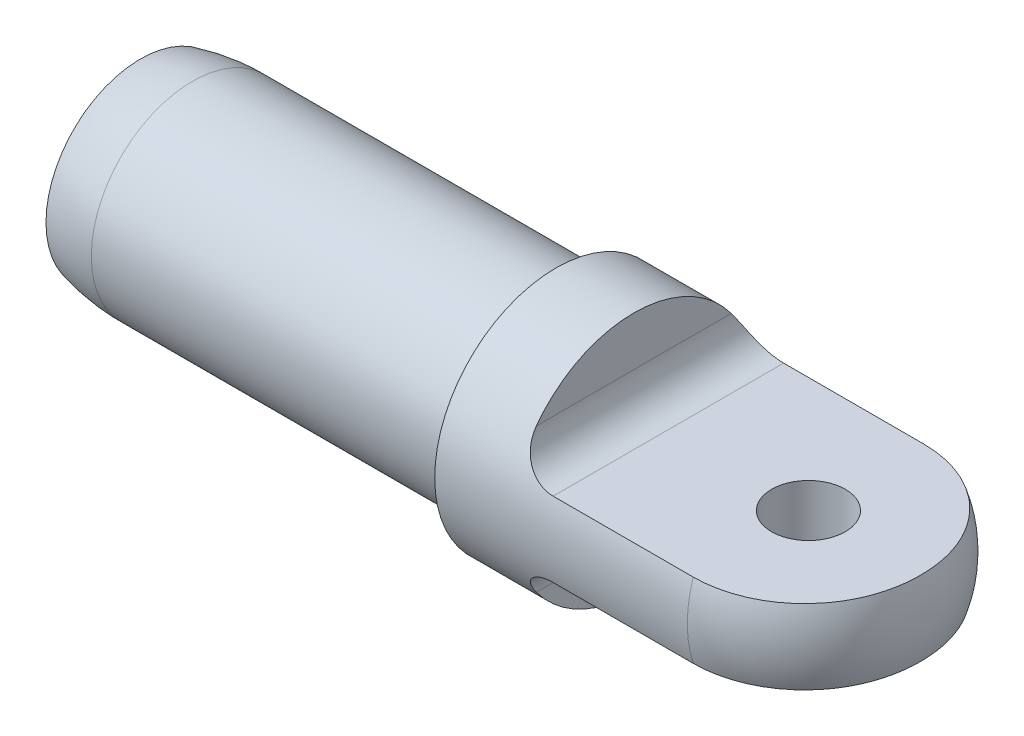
ISO-10303-21;
HEADER;
FILE_DESCRIPTION(('STEP AP214'),'2;1');
FILE_NAME('part.step','',(''),(''),'','','');
FILE_SCHEMA(('AUTOMOTIVE_DESIGN { 1 0 10303 214 1 1 1 1 }'));
ENDSEC;
DATA;
#1=APPLICATION_CONTEXT('core data for automotive mechanical design processes');
#2=APPLICATION_PROTOCOL_DEFINITION('international standard','automotive_design',2000,#1);
#3=PRODUCT_CONTEXT('',#1,'mechanical');
#4=PRODUCT('Part','Part','',(#3));
#5=PRODUCT_RELATED_PRODUCT_CATEGORY('part','',(#4));
#6=PRODUCT_DEFINITION_FORMATION('','',#4);
#7=PRODUCT_DEFINITION_CONTEXT('part definition',#1,'design');
#8=PRODUCT_DEFINITION('design','',#6,#7);
#9=PRODUCT_DEFINITION_SHAPE('','',#8);
#10=(LENGTH_UNIT() NAMED_UNIT(*) SI_UNIT(.MILLI.,.METRE.));
#11=(NAMED_UNIT(*) PLANE_ANGLE_UNIT() SI_UNIT($,.RADIAN.));
#12=(NAMED_UNIT(*) SI_UNIT($,.STERADIAN.) SOLID_ANGLE_UNIT());
#13=UNCERTAINTY_MEASURE_WITH_UNIT(LENGTH_MEASURE(1.E-05),#10,'distance_accuracy_value','');
#14=(GEOMETRIC_REPRESENTATION_CONTEXT(3) GLOBAL_UNCERTAINTY_ASSIGNED_CONTEXT((#13)) GLOBAL_UNIT_ASSIGNED_CONTEXT((#10,
#11,#12)) REPRESENTATION_CONTEXT('',''));
#15=CARTESIAN_POINT('',(0.,0.,0.));
#16=DIRECTION('',(0.,0.,1.));
#17=DIRECTION('',(1.,0.,0.));
#18=AXIS2_PLACEMENT_3D('',#15,#16,#17);
#19=CARTESIAN_POINT('',(-57.15,0.,0.));
#20=DIRECTION('',(-1.,0.,0.));
#21=DIRECTION('',(0.,0.,1.));
#22=AXIS2_PLACEMENT_3D('',#19,#20,#21);
#23=CYLINDRICAL_SURFACE('',#22,11.1125);
#24=DIRECTION('',(-1.,0.,0.));
#25=VECTOR('',#24,1.);
#26=CARTESIAN_POINT('',(-57.15,-3.42900000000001,-10.5702230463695));
#27=LINE('',#26,#25);
#28=CARTESIAN_POINT('',(-8.73125,-3.429,-10.5702230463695));
#29=VERTEX_POINT('',#28);
#30=CARTESIAN_POINT('',(4.11479999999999,-3.429,-10.5702230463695));
#31=VERTEX_POINT('',#30);
#32=EDGE_CURVE('E35',#29,#31,#27,.F.);
#33=ORIENTED_EDGE('',*,*,#32,.F.);
#34=CARTESIAN_POINT('',(-5.55625000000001,-6.604,-8.9372725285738));
#35=CARTESIAN_POINT('',(-5.55626346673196,-6.42625762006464,-9.0686018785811));
#36=CARTESIAN_POINT('',(-5.57120544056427,-6.24445322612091,-9.19467365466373));
#37=CARTESIAN_POINT('',(-5.61888568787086,-5.96957785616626,-9.37357288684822));
#38=CARTESIAN_POINT('',(-5.63900843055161,-5.87753982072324,-9.43153375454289));
#39=CARTESIAN_POINT('',(-5.68809633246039,-5.69356516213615,-9.54371735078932));
#40=CARTESIAN_POINT('',(-5.71705727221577,-5.60162851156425,-9.59794184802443));
#41=CARTESIAN_POINT('',(-5.78445426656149,-5.41796627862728,-9.70281349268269));
#42=CARTESIAN_POINT('',(-5.82297387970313,-5.32625017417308,-9.75342373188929));
#43=CARTESIAN_POINT('',(-5.90952171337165,-5.14504569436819,-9.85021337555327));
#44=CARTESIAN_POINT('',(-5.95754491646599,-5.05555617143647,-9.89639509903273));
#45=CARTESIAN_POINT('',(-6.0631009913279,-4.88002514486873,-9.98411920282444));
#46=CARTESIAN_POINT('',(-6.12062971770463,-4.79398215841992,-10.0256635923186));
#47=CARTESIAN_POINT('',(-6.24501019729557,-4.62660219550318,-10.1039965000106));
#48=CARTESIAN_POINT('',(-6.31186020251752,-4.54526434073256,-10.1407859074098));
#49=CARTESIAN_POINT('',(-6.44405008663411,-4.40001932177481,-10.2045496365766));
#50=CARTESIAN_POINT('',(-6.5081883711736,-4.33530005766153,-10.2321729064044));
#51=CARTESIAN_POINT('',(-6.64256195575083,-4.21101411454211,-10.2839460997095));
#52=CARTESIAN_POINT('',(-6.71279651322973,-4.15144680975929,-10.3080964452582));
#53=CARTESIAN_POINT('',(-6.85885484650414,-4.03820716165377,-10.3529827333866));
#54=CARTESIAN_POINT('',(-6.93467675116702,-3.98453285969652,-10.3737198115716));
#55=CARTESIAN_POINT('',(-7.09130367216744,-3.88372621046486,-10.4118791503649));
#56=CARTESIAN_POINT('',(-7.17210845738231,-3.83659356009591,-10.4293015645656));
#57=CARTESIAN_POINT('',(-7.40706407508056,-3.71323455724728,-10.4741011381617));
#58=CARTESIAN_POINT('',(-7.56643211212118,-3.64532493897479,-10.4977404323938));
#59=CARTESIAN_POINT('',(-7.89505051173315,-3.5361976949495,-10.5350044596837));
#60=CARTESIAN_POINT('',(-8.06429899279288,-3.49497500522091,-10.5486310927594));
#61=CARTESIAN_POINT('',(-8.40403637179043,-3.441330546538,-10.5662520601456));
#62=CARTESIAN_POINT('',(-8.57441942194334,-3.42830562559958,-10.5704481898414));
#63=CARTESIAN_POINT('',(-8.91505081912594,-3.42975164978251,-10.5699793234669));
#64=CARTESIAN_POINT('',(-9.08529917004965,-3.44422176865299,-10.5653145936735));
#65=CARTESIAN_POINT('',(-9.42032348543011,-3.50004169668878,-10.5469526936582));
#66=CARTESIAN_POINT('',(-9.58511374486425,-3.54131429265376,-10.5332814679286));
#67=CARTESIAN_POINT('',(-9.90506833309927,-3.64912761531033,-10.4964158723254));
#68=CARTESIAN_POINT('',(-10.0602331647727,-3.71566702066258,-10.4732220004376));
#69=CARTESIAN_POINT('',(-10.3570048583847,-3.87165478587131,-10.4165643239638));
#70=CARTESIAN_POINT('',(-10.498579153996,-3.96115637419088,-10.3830766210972));
#71=CARTESIAN_POINT('',(-10.7640722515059,-4.15947207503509,-10.3052297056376));
#72=CARTESIAN_POINT('',(-10.8879914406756,-4.26828576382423,-10.2608707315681));
#73=CARTESIAN_POINT('',(-11.1173961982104,-4.5029722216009,-10.1600905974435));
#74=CARTESIAN_POINT('',(-11.2225295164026,-4.62910535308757,-10.1034757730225));
#75=CARTESIAN_POINT('',(-11.4100718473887,-4.89208682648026,-9.97879313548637));
#76=CARTESIAN_POINT('',(-11.492476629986,-5.02893715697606,-9.91072319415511));
#77=CARTESIAN_POINT('',(-11.6384483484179,-5.31697498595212,-9.75937625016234));
#78=CARTESIAN_POINT('',(-11.7005907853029,-5.46853022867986,-9.67543247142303));
#79=CARTESIAN_POINT('',(-11.7998652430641,-5.77336014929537,-9.49669640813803));
#80=CARTESIAN_POINT('',(-11.8369865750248,-5.92663553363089,-9.40189950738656));
#81=CARTESIAN_POINT('',(-11.8913595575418,-6.25079249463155,-9.19007257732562));
#82=CARTESIAN_POINT('',(-11.9053892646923,-6.42136381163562,-9.07175526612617));
#83=CARTESIAN_POINT('',(-11.9070350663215,-6.75563539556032,-8.82565563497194));
#84=CARTESIAN_POINT('',(-11.8946367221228,-6.9193318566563,-8.69786817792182));
#85=CARTESIAN_POINT('',(-11.8528528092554,-7.19593975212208,-8.46932574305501));
#86=CARTESIAN_POINT('',(-11.8287067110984,-7.31101182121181,-8.37015500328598));
#87=CARTESIAN_POINT('',(-11.7687893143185,-7.53537878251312,-8.16874795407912));
#88=CARTESIAN_POINT('',(-11.7330133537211,-7.64467133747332,-8.06651043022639));
#89=CARTESIAN_POINT('',(-11.6506550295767,-7.85729141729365,-7.85956177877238));
#90=CARTESIAN_POINT('',(-11.6040408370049,-7.96060023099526,-7.75484419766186));
#91=CARTESIAN_POINT('',(-11.5007787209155,-8.16059904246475,-7.54409560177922));
#92=CARTESIAN_POINT('',(-11.444132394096,-8.25729009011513,-7.43806479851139));
#93=CARTESIAN_POINT('',(-11.3203175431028,-8.44525276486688,-7.22398456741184));
#94=CARTESIAN_POINT('',(-11.2530041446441,-8.53642154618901,-7.11592868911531));
#95=CARTESIAN_POINT('',(-11.1085905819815,-8.71155009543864,-6.90042244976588));
#96=CARTESIAN_POINT('',(-11.0314868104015,-8.7955071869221,-6.79297232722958));
#97=CARTESIAN_POINT('',(-10.8675683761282,-8.95556206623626,-6.5805150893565));
#98=CARTESIAN_POINT('',(-10.7807928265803,-9.03168927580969,-6.47550007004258));
#99=CARTESIAN_POINT('',(-10.5966196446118,-9.17590674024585,-6.26946255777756));
#100=CARTESIAN_POINT('',(-10.4992321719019,-9.24400455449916,-6.16843637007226));
#101=CARTESIAN_POINT('',(-10.3087112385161,-9.36129837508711,-5.98860530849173));
#102=CARTESIAN_POINT('',(-10.2173238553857,-9.41178213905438,-5.90880675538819));
#103=CARTESIAN_POINT('',(-10.0247321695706,-9.50555831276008,-5.75673460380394));
#104=CARTESIAN_POINT('',(-9.92351427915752,-9.54884053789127,-5.68447171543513));
#105=CARTESIAN_POINT('',(-9.70836719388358,-9.62709759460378,-5.55091980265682));
#106=CARTESIAN_POINT('',(-9.59427106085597,-9.66193902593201,-5.48981034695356));
#107=CARTESIAN_POINT('',(-9.41487731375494,-9.70513565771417,-5.41284408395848));
#108=CARTESIAN_POINT('',(-9.35380025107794,-9.71801131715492,-5.38966164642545));
#109=CARTESIAN_POINT('',(-9.2291509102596,-9.74035580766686,-5.34917319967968));
#110=CARTESIAN_POINT('',(-9.16558058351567,-9.74982724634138,-5.33186269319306));
#111=CARTESIAN_POINT('',(-9.01633584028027,-9.76731984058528,-5.2997706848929));
#112=CARTESIAN_POINT('',(-8.929940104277,-9.77397199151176,-5.28745339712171));
#113=CARTESIAN_POINT('',(-8.75605450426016,-9.78009373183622,-5.27612263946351));
#114=CARTESIAN_POINT('',(-8.66856525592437,-9.77956719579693,-5.27710199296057));
#115=CARTESIAN_POINT('',(-8.49528460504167,-9.77140593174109,-5.29219669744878));
#116=CARTESIAN_POINT('',(-8.40949011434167,-9.76378564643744,-5.30628535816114));
#117=CARTESIAN_POINT('',(-8.24143994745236,-9.74213895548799,-5.34592241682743));
#118=CARTESIAN_POINT('',(-8.15918831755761,-9.72810542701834,-5.37148355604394));
#119=CARTESIAN_POINT('',(-7.95761142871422,-9.68581221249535,-5.44751480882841));
#120=CARTESIAN_POINT('',(-7.8413488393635,-9.65395040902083,-5.50402230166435));
#121=CARTESIAN_POINT('',(-7.62000040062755,-9.58048271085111,-5.63093201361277));
#122=CARTESIAN_POINT('',(-7.51495073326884,-9.53884658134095,-5.70137723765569));
#123=CARTESIAN_POINT('',(-7.32676676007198,-9.45311135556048,-5.84229012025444));
#124=CARTESIAN_POINT('',(-7.24250517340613,-9.4098647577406,-5.91179843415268));
#125=CARTESIAN_POINT('',(-7.08106655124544,-9.3180654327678,-6.05545922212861));
#126=CARTESIAN_POINT('',(-7.00389494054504,-9.26950870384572,-6.12961518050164));
#127=CARTESIAN_POINT('',(-6.85586048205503,-9.16751907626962,-6.28113144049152));
#128=CARTESIAN_POINT('',(-6.78501055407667,-9.11407662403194,-6.35849785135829));
#129=CARTESIAN_POINT('',(-6.64929076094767,-9.0027027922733,-6.51523232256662));
#130=CARTESIAN_POINT('',(-6.58442241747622,-8.94477027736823,-6.59460088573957));
#131=CARTESIAN_POINT('',(-6.43387767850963,-8.79897144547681,-6.78867465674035));
#132=CARTESIAN_POINT('',(-6.35113880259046,-8.70888344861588,-6.90400194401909));
#133=CARTESIAN_POINT('',(-6.19686910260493,-8.5203436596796,-7.13538402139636));
#134=CARTESIAN_POINT('',(-6.12534331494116,-8.42188813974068,-7.25143911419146));
#135=CARTESIAN_POINT('',(-5.99382928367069,-8.21705230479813,-7.48274854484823));
#136=CARTESIAN_POINT('',(-5.93382373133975,-8.1106842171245,-7.59800382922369));
#137=CARTESIAN_POINT('',(-5.82587163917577,-7.89025677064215,-7.82666837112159));
#138=CARTESIAN_POINT('',(-5.77791965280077,-7.77620091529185,-7.9400784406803));
#139=CARTESIAN_POINT('',(-5.67905778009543,-7.49541222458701,-8.20712872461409));
#140=CARTESIAN_POINT('',(-5.63409224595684,-7.32527932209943,-8.35948133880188));
#141=CARTESIAN_POINT('',(-5.57269282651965,-6.97291825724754,-8.655575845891));
#142=CARTESIAN_POINT('',(-5.55623585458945,-6.79070000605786,-8.79932461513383));
#143=CARTESIAN_POINT('',(-5.55625000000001,-6.604,-8.9372725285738));
#144=B_SPLINE_CURVE_WITH_KNOTS('',3,(#34,#35,#36,#37,#38,#39,#40,#41,#42,#43,#44,#45,#46,#47,
#48,#49,#50,#51,#52,#53,#54,#55,#56,#57,#58,#59,#60,#61,#62,#63,#64,#65,#66,#67,#68,#69,#70,#71,
#72,#73,#74,#75,#76,#77,#78,#79,#80,#81,#82,#83,#84,#85,#86,#87,#88,#89,#90,#91,#92,#93,#94,#95,
#96,#97,#98,#99,#100,#101,#102,#103,#104,#105,#106,#107,#108,#109,#110,#111,#112,#113,#114,#115,
#116,#117,#118,#119,#120,#121,#122,#123,#124,#125,#126,#127,#128,#129,#130,#131,#132,#133,#134,
#135,#136,#137,#138,#139,#140,#141,#142,#143),.UNSPECIFIED.,.T.,.F.,(4,2,2,2,2,2,2,2,2,2,2,2,2,
2,2,2,2,2,2,2,2,2,2,2,2,2,2,2,2,2,2,2,2,2,2,2,2,2,2,2,2,2,2,2,2,2,2,2,2,2,2,2,2,2,4),(0.,
0.662256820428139,0.993751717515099,1.32508860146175,1.65943077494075,1.99359690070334,
2.3276176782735,2.66157590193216,2.9468300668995,3.23204953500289,3.51717391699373,
3.80228508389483,4.32400848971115,4.8456328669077,5.3559846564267,5.86632110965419,
6.37519385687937,6.88403999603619,7.39407651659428,7.90410184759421,8.42286660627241,
8.94172785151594,9.49167688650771,10.041860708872,10.6637832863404,11.286045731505,
11.7469273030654,12.2079938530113,12.6704319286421,13.1327964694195,13.6020853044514,
14.0715475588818,14.5391758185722,15.0063602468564,15.3999584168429,15.7941085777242,
16.1941320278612,16.3935585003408,16.5928318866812,16.8541302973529,17.1152876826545,
17.3759145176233,17.6368315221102,18.0339624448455,18.4323383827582,18.7842882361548,
19.1365051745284,19.4894262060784,19.84243677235,20.3461336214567,20.8500560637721,
21.3532153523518,21.8561468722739,22.5523432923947,23.2479756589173),.UNSPECIFIED.);
#145=CARTESIAN_POINT('',(-11.90625,-6.604,-8.9372725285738));
#146=VERTEX_POINT('',#145);
#147=EDGE_CURVE('E10',#29,#146,#144,.T.);
#148=ORIENTED_EDGE('',*,*,#147,.T.);
#149=CARTESIAN_POINT('',(-11.90625,0.,0.));
#150=DIRECTION('',(-1.,0.,0.));
#151=DIRECTION('',(0.,-1.,0.));
#152=AXIS2_PLACEMENT_3D('',#149,#150,#151);
#153=CIRCLE('',#152,11.1125);
#154=CARTESIAN_POINT('',(-11.90625,-6.604,8.9372725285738));
#155=VERTEX_POINT('',#154);
#156=EDGE_CURVE('E177',#155,#146,#153,.F.);
#157=ORIENTED_EDGE('',*,*,#156,.F.);
#158=CARTESIAN_POINT('',(-5.55625000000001,-6.604,8.9372725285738));
#159=CARTESIAN_POINT('',(-5.55624989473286,-6.71209827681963,8.8573949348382));
#160=CARTESIAN_POINT('',(-5.56177132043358,-6.81876648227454,8.77553539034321));
#161=CARTESIAN_POINT('',(-5.58298715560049,-7.02848468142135,8.60848774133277));
#162=CARTESIAN_POINT('',(-5.59868858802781,-7.13153212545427,8.52329737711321));
#163=CARTESIAN_POINT('',(-5.6395199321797,-7.33372507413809,8.34996428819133));
#164=CARTESIAN_POINT('',(-5.6646778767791,-7.43285799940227,8.26181350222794));
#165=CARTESIAN_POINT('',(-5.72368858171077,-7.62646631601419,8.08344196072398));
#166=CARTESIAN_POINT('',(-5.75753990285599,-7.72094247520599,7.99322155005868));
#167=CARTESIAN_POINT('',(-5.87522152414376,-8.00673881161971,7.71062620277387));
#168=CARTESIAN_POINT('',(-5.9729718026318,-8.18983348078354,7.51542801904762));
#169=CARTESIAN_POINT('',(-6.14375646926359,-8.44684345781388,7.22187968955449));
#170=CARTESIAN_POINT('',(-6.20472995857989,-8.52959372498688,7.12387985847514));
#171=CARTESIAN_POINT('',(-6.3347261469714,-8.68915917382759,6.9283503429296));
#172=CARTESIAN_POINT('',(-6.4037471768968,-8.76597558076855,6.83082056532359));
#173=CARTESIAN_POINT('',(-6.53482933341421,-8.89815274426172,6.65731579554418));
#174=CARTESIAN_POINT('',(-6.59537067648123,-8.95466187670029,6.58106063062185));
#175=CARTESIAN_POINT('',(-6.72182993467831,-9.06363883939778,6.43014470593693));
#176=CARTESIAN_POINT('',(-6.78774685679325,-9.11610741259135,6.3554836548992));
#177=CARTESIAN_POINT('',(-6.9252422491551,-9.21670166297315,6.20870101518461));
#178=CARTESIAN_POINT('',(-6.99681268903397,-9.26483329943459,6.13657602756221));
#179=CARTESIAN_POINT('',(-7.1461983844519,-9.35643681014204,5.99598036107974));
#180=CARTESIAN_POINT('',(-7.22401013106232,-9.3999112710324,5.92750766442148));
#181=CARTESIAN_POINT('',(-7.39767562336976,-9.48721114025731,5.78689961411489));
#182=CARTESIAN_POINT('',(-7.49454434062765,-9.53028189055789,5.71553037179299));
#183=CARTESIAN_POINT('',(-7.6983837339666,-9.60827822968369,5.58341389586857));
#184=CARTESIAN_POINT('',(-7.80534156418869,-9.64321398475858,5.52265342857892));
#185=CARTESIAN_POINT('',(-8.00405403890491,-9.69589240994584,5.42950463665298));
#186=CARTESIAN_POINT('',(-8.09366357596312,-9.71574084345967,5.39380516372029));
#187=CARTESIAN_POINT('',(-8.27831454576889,-9.74791756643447,5.33543648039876));
#188=CARTESIAN_POINT('',(-8.37334663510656,-9.76025838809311,5.31274555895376));
#189=CARTESIAN_POINT('',(-8.5676117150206,-9.77628762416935,5.2831968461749));
#190=CARTESIAN_POINT('',(-8.66687626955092,-9.77989186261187,5.27649309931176));
#191=CARTESIAN_POINT('',(-8.86496040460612,-9.77772957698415,5.2804983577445));
#192=CARTESIAN_POINT('',(-8.96377989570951,-9.77196124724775,5.2912107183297));
#193=CARTESIAN_POINT('',(-9.1446507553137,-9.75311281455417,5.32585690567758));
#194=CARTESIAN_POINT('',(-9.22720246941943,-9.74108996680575,5.34787411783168));
#195=CARTESIAN_POINT('',(-9.38798007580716,-9.71141345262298,5.40157869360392));
#196=CARTESIAN_POINT('',(-9.4662040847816,-9.69375735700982,5.43327022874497));
#197=CARTESIAN_POINT('',(-9.67637455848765,-9.63825489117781,5.53143876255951));
#198=CARTESIAN_POINT('',(-9.80322174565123,-9.59533940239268,5.60589245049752));
#199=CARTESIAN_POINT('',(-10.0429665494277,-9.49828127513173,5.7688284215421));
#200=CARTESIAN_POINT('',(-10.1558066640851,-9.44409465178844,5.8573653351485));
#201=CARTESIAN_POINT('',(-10.3575062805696,-9.33303697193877,6.03255006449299));
#202=CARTESIAN_POINT('',(-10.4476389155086,-9.27710459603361,6.11834913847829));
#203=CARTESIAN_POINT('',(-10.619275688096,-9.15877216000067,6.29410723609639));
#204=CARTESIAN_POINT('',(-10.7007732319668,-9.09636722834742,6.3840693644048));
#205=CARTESIAN_POINT('',(-10.8558819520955,-8.96553772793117,6.56653735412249));
#206=CARTESIAN_POINT('',(-10.9294856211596,-8.89710753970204,6.65904553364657));
#207=CARTESIAN_POINT('',(-11.0691064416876,-8.75458110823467,6.84534311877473));
#208=CARTESIAN_POINT('',(-11.1351255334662,-8.68048632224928,6.93913218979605));
#209=CARTESIAN_POINT('',(-11.264134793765,-8.52137722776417,7.13377044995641));
#210=CARTESIAN_POINT('',(-11.3265828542,-8.43596134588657,7.23465100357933));
#211=CARTESIAN_POINT('',(-11.4428572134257,-8.25899823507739,7.43603233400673));
#212=CARTESIAN_POINT('',(-11.4966823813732,-8.16745020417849,7.53653305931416));
#213=CARTESIAN_POINT('',(-11.595276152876,-7.97852471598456,7.73625708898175));
#214=CARTESIAN_POINT('',(-11.6400551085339,-7.88115408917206,7.83548173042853));
#215=CARTESIAN_POINT('',(-11.7200617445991,-7.68069710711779,8.03207675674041));
#216=CARTESIAN_POINT('',(-11.7552868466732,-7.57760921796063,8.12944663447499));
#217=CARTESIAN_POINT('',(-11.8117951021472,-7.37874787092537,8.31008798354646));
#218=CARTESIAN_POINT('',(-11.8342412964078,-7.28357246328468,8.39365374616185));
#219=CARTESIAN_POINT('',(-11.8704705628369,-7.08945590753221,8.55823937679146));
#220=CARTESIAN_POINT('',(-11.8842551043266,-6.99051540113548,8.63925967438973));
#221=CARTESIAN_POINT('',(-11.902436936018,-6.78940684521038,8.79818187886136));
#222=CARTESIAN_POINT('',(-11.9068412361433,-6.68724126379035,8.87608607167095));
#223=CARTESIAN_POINT('',(-11.9055302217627,-6.48035500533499,9.02824394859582));
#224=CARTESIAN_POINT('',(-11.8998169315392,-6.37563484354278,9.10249835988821));
#225=CARTESIAN_POINT('',(-11.8704198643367,-6.09796636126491,9.29223324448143));
#226=CARTESIAN_POINT('',(-11.8377062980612,-5.9234563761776,9.40433071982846));
#227=CARTESIAN_POINT('',(-11.7647593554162,-5.66238048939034,9.56219499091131));
#228=CARTESIAN_POINT('',(-11.7364492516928,-5.57543773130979,9.61311983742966));
#229=CARTESIAN_POINT('',(-11.6716092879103,-5.40257714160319,9.71131584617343));
#230=CARTESIAN_POINT('',(-11.6350835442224,-5.31665881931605,9.75858882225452));
#231=CARTESIAN_POINT('',(-11.553339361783,-5.14610759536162,9.84960193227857));
#232=CARTESIAN_POINT('',(-11.508056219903,-5.06148966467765,9.89331209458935));
#233=CARTESIAN_POINT('',(-11.4089914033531,-4.89529360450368,9.97659208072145));
#234=CARTESIAN_POINT('',(-11.3552138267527,-4.81371403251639,10.0161638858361));
#235=CARTESIAN_POINT('',(-11.2393073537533,-4.65465248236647,10.0910651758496));
#236=CARTESIAN_POINT('',(-11.177179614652,-4.57716993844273,10.1263952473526));
#237=CARTESIAN_POINT('',(-11.0449022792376,-4.42739334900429,10.1927697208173));
#238=CARTESIAN_POINT('',(-10.9747537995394,-4.35509858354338,10.2238147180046));
#239=CARTESIAN_POINT('',(-10.8360569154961,-4.2252833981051,10.2780816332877));
#240=CARTESIAN_POINT('',(-10.7683756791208,-4.16704000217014,10.3017961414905));
#241=CARTESIAN_POINT('',(-10.627659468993,-4.05600250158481,10.3460172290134));
#242=CARTESIAN_POINT('',(-10.5546227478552,-4.00321018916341,10.3665227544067));
#243=CARTESIAN_POINT('',(-10.4037922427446,-3.90374478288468,10.4043869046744));
#244=CARTESIAN_POINT('',(-10.3260017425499,-3.85706753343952,10.421747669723));
#245=CARTESIAN_POINT('',(-10.16622429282,-3.77031779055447,10.4534437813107));
#246=CARTESIAN_POINT('',(-10.0842358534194,-3.73024766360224,10.4677780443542));
#247=CARTESIAN_POINT('',(-9.84378414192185,-3.62540607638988,10.5047319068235));
#248=CARTESIAN_POINT('',(-9.68079074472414,-3.56943674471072,10.5237237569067));
#249=CARTESIAN_POINT('',(-9.34721096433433,-3.48456419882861,10.5521319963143));
#250=CARTESIAN_POINT('',(-9.17662560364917,-3.45565735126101,10.5615496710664));
#251=CARTESIAN_POINT('',(-8.83530265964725,-3.4261561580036,10.5711564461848));
#252=CARTESIAN_POINT('',(-8.66460471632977,-3.42514900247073,10.5714801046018));
#253=CARTESIAN_POINT('',(-8.32546952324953,-3.45044909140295,10.5632490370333));
#254=CARTESIAN_POINT('',(-8.15703221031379,-3.47675557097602,10.5546945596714));
#255=CARTESIAN_POINT('',(-7.82744724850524,-3.55565090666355,10.5283764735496));
#256=CARTESIAN_POINT('',(-7.66628915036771,-3.60820069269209,10.5106265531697));
#257=CARTESIAN_POINT('',(-7.35553097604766,-3.73758285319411,10.4653141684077));
#258=CARTESIAN_POINT('',(-7.20593035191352,-3.81441407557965,10.4377521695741));
#259=CARTESIAN_POINT('',(-6.92175176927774,-3.98974560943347,10.3719983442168));
#260=CARTESIAN_POINT('',(-6.7872370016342,-4.0883322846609,10.3337639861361));
#261=CARTESIAN_POINT('',(-6.53726297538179,-4.30308637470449,10.2461951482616));
#262=CARTESIAN_POINT('',(-6.42180274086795,-4.4192528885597,10.1968612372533));
#263=CARTESIAN_POINT('',(-6.20971128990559,-4.66757141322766,10.0856498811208));
#264=CARTESIAN_POINT('',(-6.11358712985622,-4.8000352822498,10.0235045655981));
#265=CARTESIAN_POINT('',(-5.94471390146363,-5.0737281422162,9.88778421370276));
#266=CARTESIAN_POINT('',(-5.8719773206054,-5.21496176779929,9.81420310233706));
#267=CARTESIAN_POINT('',(-5.74523105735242,-5.51207052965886,9.65067674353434));
#268=CARTESIAN_POINT('',(-5.69300620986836,-5.6682555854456,9.55992334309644));
#269=CARTESIAN_POINT('',(-5.6139510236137,-5.98032360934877,9.36786648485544));
#270=CARTESIAN_POINT('',(-5.58710094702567,-6.13620671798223,9.26657129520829));
#271=CARTESIAN_POINT('',(-5.56655620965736,-6.34291027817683,9.12465301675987));
#272=CARTESIAN_POINT('',(-5.56266673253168,-6.39554187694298,9.08784021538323));
#273=CARTESIAN_POINT('',(-5.55751427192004,-6.50022461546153,9.01326007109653));
#274=CARTESIAN_POINT('',(-5.55625005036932,-6.55227601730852,8.97549318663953));
#275=CARTESIAN_POINT('',(-5.55625000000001,-6.604,8.9372725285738));
#276=B_SPLINE_CURVE_WITH_KNOTS('',3,(#158,#159,#160,#161,#162,#163,#164,#165,#166,#167,#168,
#169,#170,#171,#172,#173,#174,#175,#176,#177,#178,#179,#180,#181,#182,#183,#184,#185,#186,#187,
#188,#189,#190,#191,#192,#193,#194,#195,#196,#197,#198,#199,#200,#201,#202,#203,#204,#205,#206,
#207,#208,#209,#210,#211,#212,#213,#214,#215,#216,#217,#218,#219,#220,#221,#222,#223,#224,#225,
#226,#227,#228,#229,#230,#231,#232,#233,#234,#235,#236,#237,#238,#239,#240,#241,#242,#243,#244,
#245,#246,#247,#248,#249,#250,#251,#252,#253,#254,#255,#256,#257,#258,#259,#260,#261,#262,#263,
#264,#265,#266,#267,#268,#269,#270,#271,#272,#273,#274,#275),.UNSPECIFIED.,.T.,.F.,(4,2,2,2,2,2,
2,2,2,2,2,2,2,2,2,2,2,2,2,2,2,2,2,2,2,2,2,2,2,2,2,2,2,2,2,2,2,2,2,2,2,2,2,2,2,2,2,2,2,2,2,2,2,2,
2,2,2,2,4),(0.,0.403157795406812,0.806594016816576,1.2112357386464,1.61581051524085,
2.46700778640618,2.89282473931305,3.31855352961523,3.65609737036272,3.99357899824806,
4.33058959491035,4.66741203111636,5.0499918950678,5.43209105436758,5.72649008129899,
6.02039631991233,6.31712324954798,6.61390735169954,6.87179852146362,7.12980105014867,
7.58679960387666,8.04561619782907,8.45434947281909,8.86339264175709,9.2728214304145,
9.68214524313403,10.1203409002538,10.5585939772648,10.9963426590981,11.434209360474,
11.8197508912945,12.2052270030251,12.5904149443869,12.9755258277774,13.6023990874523,
13.9160698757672,14.2295838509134,14.545509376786,14.8612829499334,15.1770128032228,
15.4926987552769,15.7695009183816,16.0463938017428,16.3230975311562,16.5999001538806,
17.1172946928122,17.6346197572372,18.1442862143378,18.6539383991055,19.1628340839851,
19.6717056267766,20.1826348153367,20.693537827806,21.2164641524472,21.7396692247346,
22.3016045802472,22.8631024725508,23.056100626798,23.2490077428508),.UNSPECIFIED.);
#277=CARTESIAN_POINT('',(-8.73125,-3.429,10.5702230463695));
#278=VERTEX_POINT('',#277);
#279=EDGE_CURVE('E28',#155,#278,#276,.T.);
#280=ORIENTED_EDGE('',*,*,#279,.T.);
#281=DIRECTION('',(-1.,0.,0.));
#282=VECTOR('',#281,1.);
#283=CARTESIAN_POINT('',(-57.15,-3.42900000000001,10.5702230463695));
#284=LINE('',#283,#282);
#285=CARTESIAN_POINT('',(4.11479999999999,-3.429,10.5702230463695));
#286=VERTEX_POINT('',#285);
#287=EDGE_CURVE('E86',#286,#278,#284,.T.);
#288=ORIENTED_EDGE('',*,*,#287,.F.);
#289=CARTESIAN_POINT('',(4.11479999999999,0.,0.));
#290=DIRECTION('',(-1.,0.,0.));
#291=DIRECTION('',(0.,0.,1.));
#292=AXIS2_PLACEMENT_3D('',#289,#290,#291);
#293=CIRCLE('',#292,11.1125);
#294=CARTESIAN_POINT('',(4.11479999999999,3.429,10.5702230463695));
#295=VERTEX_POINT('',#294);
#296=EDGE_CURVE('E108',#286,#295,#293,.T.);
#297=ORIENTED_EDGE('',*,*,#296,.T.);
#298=DIRECTION('',(-1.,0.,0.));
#299=VECTOR('',#298,1.);
#300=CARTESIAN_POINT('',(-57.15,3.42899999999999,10.5702230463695));
#301=LINE('',#300,#299);
#302=CARTESIAN_POINT('',(-8.73125,3.429,10.5702230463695));
#303=VERTEX_POINT('',#302);
#304=EDGE_CURVE('E102',#295,#303,#301,.T.);
#305=ORIENTED_EDGE('',*,*,#304,.T.);
#306=CARTESIAN_POINT('',(-5.55625000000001,6.604,8.9372725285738));
#307=CARTESIAN_POINT('',(-5.55624989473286,6.71209827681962,8.8573949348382));
#308=CARTESIAN_POINT('',(-5.56177132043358,6.81876648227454,8.77553539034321));
#309=CARTESIAN_POINT('',(-5.58298715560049,7.02848468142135,8.60848774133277));
#310=CARTESIAN_POINT('',(-5.59868858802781,7.13153212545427,8.52329737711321));
#311=CARTESIAN_POINT('',(-5.6395199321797,7.33372507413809,8.34996428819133));
#312=CARTESIAN_POINT('',(-5.6646778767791,7.43285799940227,8.26181350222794));
#313=CARTESIAN_POINT('',(-5.72368858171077,7.62646631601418,8.08344196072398));
#314=CARTESIAN_POINT('',(-5.75753990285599,7.72094247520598,7.99322155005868));
#315=CARTESIAN_POINT('',(-5.87522152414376,8.00673881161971,7.71062620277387));
#316=CARTESIAN_POINT('',(-5.9729718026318,8.18983348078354,7.51542801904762));
#317=CARTESIAN_POINT('',(-6.14375646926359,8.44684345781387,7.22187968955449));
#318=CARTESIAN_POINT('',(-6.20472995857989,8.52959372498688,7.12387985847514));
#319=CARTESIAN_POINT('',(-6.3347261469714,8.68915917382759,6.9283503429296));
#320=CARTESIAN_POINT('',(-6.4037471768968,8.76597558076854,6.83082056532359));
#321=CARTESIAN_POINT('',(-6.53482933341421,8.89815274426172,6.65731579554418));
#322=CARTESIAN_POINT('',(-6.59537067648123,8.95466187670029,6.58106063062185));
#323=CARTESIAN_POINT('',(-6.72182993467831,9.06363883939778,6.43014470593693));
#324=CARTESIAN_POINT('',(-6.78774685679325,9.11610741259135,6.3554836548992));
#325=CARTESIAN_POINT('',(-6.9252422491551,9.21670166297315,6.20870101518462));
#326=CARTESIAN_POINT('',(-6.99681268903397,9.26483329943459,6.13657602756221));
#327=CARTESIAN_POINT('',(-7.1461983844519,9.35643681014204,5.99598036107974));
#328=CARTESIAN_POINT('',(-7.22401013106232,9.3999112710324,5.92750766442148));
#329=CARTESIAN_POINT('',(-7.39767562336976,9.48721114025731,5.78689961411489));
#330=CARTESIAN_POINT('',(-7.49454434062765,9.53028189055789,5.71553037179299));
#331=CARTESIAN_POINT('',(-7.6983837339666,9.60827822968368,5.58341389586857));
#332=CARTESIAN_POINT('',(-7.80534156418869,9.64321398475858,5.52265342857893));
#333=CARTESIAN_POINT('',(-8.00405403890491,9.69589240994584,5.42950463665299));
#334=CARTESIAN_POINT('',(-8.09366357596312,9.71574084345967,5.39380516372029));
#335=CARTESIAN_POINT('',(-8.27831454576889,9.74791756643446,5.33543648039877));
#336=CARTESIAN_POINT('',(-8.37334663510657,9.76025838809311,5.31274555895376));
#337=CARTESIAN_POINT('',(-8.5676117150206,9.77628762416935,5.2831968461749));
#338=CARTESIAN_POINT('',(-8.66687626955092,9.77989186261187,5.27649309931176));
#339=CARTESIAN_POINT('',(-8.86496040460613,9.77772957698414,5.2804983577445));
#340=CARTESIAN_POINT('',(-8.96377989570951,9.77196124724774,5.2912107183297));
#341=CARTESIAN_POINT('',(-9.1446507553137,9.75311281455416,5.32585690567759));
#342=CARTESIAN_POINT('',(-9.22720246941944,9.74108996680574,5.34787411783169));
#343=CARTESIAN_POINT('',(-9.38798007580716,9.71141345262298,5.40157869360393));
#344=CARTESIAN_POINT('',(-9.46620408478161,9.69375735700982,5.43327022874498));
#345=CARTESIAN_POINT('',(-9.67637455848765,9.63825489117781,5.53143876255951));
#346=CARTESIAN_POINT('',(-9.80322174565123,9.59533940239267,5.60589245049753));
#347=CARTESIAN_POINT('',(-10.0429665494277,9.49828127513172,5.7688284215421));
#348=CARTESIAN_POINT('',(-10.1558066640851,9.44409465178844,5.8573653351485));
#349=CARTESIAN_POINT('',(-10.3575062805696,9.33303697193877,6.03255006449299));
#350=CARTESIAN_POINT('',(-10.4476389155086,9.2771045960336,6.11834913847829));
#351=CARTESIAN_POINT('',(-10.619275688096,9.15877216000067,6.2941072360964));
#352=CARTESIAN_POINT('',(-10.7007732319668,9.09636722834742,6.38406936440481));
#353=CARTESIAN_POINT('',(-10.8558819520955,8.96553772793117,6.56653735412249));
#354=CARTESIAN_POINT('',(-10.9294856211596,8.89710753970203,6.65904553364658));
#355=CARTESIAN_POINT('',(-11.0691064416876,8.75458110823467,6.84534311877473));
#356=CARTESIAN_POINT('',(-11.1351255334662,8.68048632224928,6.93913218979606));
#357=CARTESIAN_POINT('',(-11.264134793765,8.52137722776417,7.13377044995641));
#358=CARTESIAN_POINT('',(-11.3265828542,8.43596134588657,7.23465100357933));
#359=CARTESIAN_POINT('',(-11.4428572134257,8.25899823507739,7.43603233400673));
#360=CARTESIAN_POINT('',(-11.4966823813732,8.16745020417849,7.53653305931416));
#361=CARTESIAN_POINT('',(-11.595276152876,7.97852471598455,7.73625708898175));
#362=CARTESIAN_POINT('',(-11.6400551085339,7.88115408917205,7.83548173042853));
#363=CARTESIAN_POINT('',(-11.7200617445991,7.68069710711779,8.03207675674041));
#364=CARTESIAN_POINT('',(-11.7552868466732,7.57760921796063,8.12944663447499));
#365=CARTESIAN_POINT('',(-11.8117951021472,7.37874787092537,8.31008798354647));
#366=CARTESIAN_POINT('',(-11.8342412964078,7.28357246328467,8.39365374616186));
#367=CARTESIAN_POINT('',(-11.8704705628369,7.08945590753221,8.55823937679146));
#368=CARTESIAN_POINT('',(-11.8842551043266,6.99051540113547,8.63925967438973));
#369=CARTESIAN_POINT('',(-11.902436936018,6.78940684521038,8.79818187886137));
#370=CARTESIAN_POINT('',(-11.9068412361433,6.68724126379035,8.87608607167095));
#371=CARTESIAN_POINT('',(-11.9055302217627,6.48035500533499,9.02824394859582));
#372=CARTESIAN_POINT('',(-11.8998169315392,6.37563484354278,9.10249835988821));
#373=CARTESIAN_POINT('',(-11.8704198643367,6.0979663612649,9.29223324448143));
#374=CARTESIAN_POINT('',(-11.8377062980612,5.9234563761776,9.40433071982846));
#375=CARTESIAN_POINT('',(-11.7647593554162,5.66238048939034,9.56219499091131));
#376=CARTESIAN_POINT('',(-11.7364492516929,5.57543773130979,9.61311983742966));
#377=CARTESIAN_POINT('',(-11.6716092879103,5.40257714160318,9.71131584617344));
#378=CARTESIAN_POINT('',(-11.6350835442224,5.31665881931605,9.75858882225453));
#379=CARTESIAN_POINT('',(-11.553339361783,5.14610759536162,9.84960193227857));
#380=CARTESIAN_POINT('',(-11.508056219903,5.06148966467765,9.89331209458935));
#381=CARTESIAN_POINT('',(-11.4089914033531,4.89529360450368,9.97659208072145));
#382=CARTESIAN_POINT('',(-11.3552138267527,4.81371403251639,10.0161638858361));
#383=CARTESIAN_POINT('',(-11.2393073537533,4.65465248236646,10.0910651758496));
#384=CARTESIAN_POINT('',(-11.177179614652,4.57716993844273,10.1263952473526));
#385=CARTESIAN_POINT('',(-11.0449022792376,4.42739334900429,10.1927697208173));
#386=CARTESIAN_POINT('',(-10.9747537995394,4.35509858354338,10.2238147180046));
#387=CARTESIAN_POINT('',(-10.8360569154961,4.2252833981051,10.2780816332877));
#388=CARTESIAN_POINT('',(-10.7683756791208,4.16704000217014,10.3017961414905));
#389=CARTESIAN_POINT('',(-10.627659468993,4.05600250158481,10.3460172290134));
#390=CARTESIAN_POINT('',(-10.5546227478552,4.00321018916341,10.3665227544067));
#391=CARTESIAN_POINT('',(-10.4037922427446,3.90374478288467,10.4043869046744));
#392=CARTESIAN_POINT('',(-10.3260017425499,3.85706753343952,10.421747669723));
#393=CARTESIAN_POINT('',(-10.16622429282,3.77031779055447,10.4534437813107));
#394=CARTESIAN_POINT('',(-10.0842358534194,3.73024766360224,10.4677780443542));
#395=CARTESIAN_POINT('',(-9.84378414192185,3.62540607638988,10.5047319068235));
#396=CARTESIAN_POINT('',(-9.68079074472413,3.56943674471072,10.5237237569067));
#397=CARTESIAN_POINT('',(-9.34721096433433,3.48456419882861,10.5521319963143));
#398=CARTESIAN_POINT('',(-9.17662560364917,3.45565735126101,10.5615496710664));
#399=CARTESIAN_POINT('',(-8.83530265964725,3.4261561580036,10.5711564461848));
#400=CARTESIAN_POINT('',(-8.66460471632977,3.42514900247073,10.5714801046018));
#401=CARTESIAN_POINT('',(-8.32546952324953,3.45044909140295,10.5632490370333));
#402=CARTESIAN_POINT('',(-8.15703221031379,3.47675557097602,10.5546945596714));
#403=CARTESIAN_POINT('',(-7.82744724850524,3.55565090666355,10.5283764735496));
#404=CARTESIAN_POINT('',(-7.66628915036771,3.60820069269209,10.5106265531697));
#405=CARTESIAN_POINT('',(-7.35553097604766,3.73758285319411,10.4653141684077));
#406=CARTESIAN_POINT('',(-7.20593035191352,3.81441407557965,10.4377521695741));
#407=CARTESIAN_POINT('',(-6.92175176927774,3.98974560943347,10.3719983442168));
#408=CARTESIAN_POINT('',(-6.7872370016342,4.0883322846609,10.3337639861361));
#409=CARTESIAN_POINT('',(-6.53726297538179,4.30308637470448,10.2461951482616));
#410=CARTESIAN_POINT('',(-6.42180274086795,4.4192528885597,10.1968612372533));
#411=CARTESIAN_POINT('',(-6.20971128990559,4.66757141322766,10.0856498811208));
#412=CARTESIAN_POINT('',(-6.11358712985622,4.8000352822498,10.0235045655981));
#413=CARTESIAN_POINT('',(-5.94471390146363,5.0737281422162,9.88778421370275));
#414=CARTESIAN_POINT('',(-5.8719773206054,5.21496176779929,9.81420310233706));
#415=CARTESIAN_POINT('',(-5.74523105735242,5.51207052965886,9.65067674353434));
#416=CARTESIAN_POINT('',(-5.69300620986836,5.6682555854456,9.55992334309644));
#417=CARTESIAN_POINT('',(-5.6139510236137,5.98032360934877,9.36786648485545));
#418=CARTESIAN_POINT('',(-5.58710094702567,6.13620671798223,9.26657129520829));
#419=CARTESIAN_POINT('',(-5.56655620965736,6.34291027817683,9.12465301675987));
#420=CARTESIAN_POINT('',(-5.56266673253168,6.39554187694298,9.08784021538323));
#421=CARTESIAN_POINT('',(-5.55751427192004,6.50022461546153,9.01326007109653));
#422=CARTESIAN_POINT('',(-5.55625005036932,6.55227601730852,8.97549318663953));
#423=CARTESIAN_POINT('',(-5.55625000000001,6.604,8.9372725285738));
#424=B_SPLINE_CURVE_WITH_KNOTS('',3,(#306,#307,#308,#309,#310,#311,#312,#313,#314,#315,#316,
#317,#318,#319,#320,#321,#322,#323,#324,#325,#326,#327,#328,#329,#330,#331,#332,#333,#334,#335,
#336,#337,#338,#339,#340,#341,#342,#343,#344,#345,#346,#347,#348,#349,#350,#351,#352,#353,#354,
#355,#356,#357,#358,#359,#360,#361,#362,#363,#364,#365,#366,#367,#368,#369,#370,#371,#372,#373,
#374,#375,#376,#377,#378,#379,#380,#381,#382,#383,#384,#385,#386,#387,#388,#389,#390,#391,#392,
#393,#394,#395,#396,#397,#398,#399,#400,#401,#402,#403,#404,#405,#406,#407,#408,#409,#410,#411,
#412,#413,#414,#415,#416,#417,#418,#419,#420,#421,#422,#423),.UNSPECIFIED.,.T.,.F.,(4,2,2,2,2,2,
2,2,2,2,2,2,2,2,2,2,2,2,2,2,2,2,2,2,2,2,2,2,2,2,2,2,2,2,2,2,2,2,2,2,2,2,2,2,2,2,2,2,2,2,2,2,2,2,
2,2,2,2,4),(0.,0.403157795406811,0.806594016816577,1.2112357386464,1.61581051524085,
2.46700778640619,2.89282473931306,3.31855352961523,3.65609737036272,3.99357899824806,
4.33058959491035,4.66741203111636,5.04999189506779,5.43209105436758,5.72649008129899,
6.02039631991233,6.31712324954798,6.61390735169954,6.87179852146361,7.12980105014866,
7.58679960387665,8.04561619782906,8.45434947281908,8.86339264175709,9.2728214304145,
9.68214524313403,10.1203409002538,10.5585939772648,10.9963426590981,11.434209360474,
11.8197508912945,12.2052270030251,12.5904149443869,12.9755258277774,13.6023990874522,
13.9160698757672,14.2295838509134,14.545509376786,14.8612829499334,15.1770128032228,
15.4926987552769,15.7695009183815,16.0463938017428,16.3230975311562,16.5999001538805,
17.1172946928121,17.6346197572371,18.1442862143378,18.6539383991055,19.1628340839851,
19.6717056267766,20.1826348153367,20.693537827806,21.2164641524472,21.7396692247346,
22.3016045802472,22.8631024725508,23.056100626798,23.2490077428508),.UNSPECIFIED.);
#425=CARTESIAN_POINT('',(-11.90625,6.604,8.9372725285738));
#426=VERTEX_POINT('',#425);
#427=EDGE_CURVE('E135',#426,#303,#424,.T.);
#428=ORIENTED_EDGE('',*,*,#427,.F.);
#429=CARTESIAN_POINT('',(-11.90625,0.,0.));
#430=DIRECTION('',(-1.,0.,0.));
#431=DIRECTION('',(0.,-1.,0.));
#432=AXIS2_PLACEMENT_3D('',#429,#430,#431);
#433=CIRCLE('',#432,11.1125);
#434=CARTESIAN_POINT('',(-11.90625,6.604,-8.9372725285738));
#435=VERTEX_POINT('',#434);
#436=EDGE_CURVE('E162',#435,#426,#433,.F.);
#437=ORIENTED_EDGE('',*,*,#436,.F.);
#438=CARTESIAN_POINT('',(-5.55625000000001,6.604,-8.9372725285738));
#439=CARTESIAN_POINT('',(-5.55626346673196,6.42625762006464,-9.0686018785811));
#440=CARTESIAN_POINT('',(-5.57120544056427,6.24445322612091,-9.19467365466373));
#441=CARTESIAN_POINT('',(-5.61888568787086,5.96957785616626,-9.37357288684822));
#442=CARTESIAN_POINT('',(-5.63900843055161,5.87753982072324,-9.43153375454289));
#443=CARTESIAN_POINT('',(-5.68809633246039,5.69356516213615,-9.54371735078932));
#444=CARTESIAN_POINT('',(-5.71705727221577,5.60162851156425,-9.59794184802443));
#445=CARTESIAN_POINT('',(-5.78445426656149,5.41796627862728,-9.70281349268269));
#446=CARTESIAN_POINT('',(-5.82297387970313,5.32625017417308,-9.75342373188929));
#447=CARTESIAN_POINT('',(-5.90952171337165,5.14504569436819,-9.85021337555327));
#448=CARTESIAN_POINT('',(-5.95754491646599,5.05555617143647,-9.89639509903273));
#449=CARTESIAN_POINT('',(-6.0631009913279,4.88002514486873,-9.98411920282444));
#450=CARTESIAN_POINT('',(-6.12062971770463,4.79398215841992,-10.0256635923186));
#451=CARTESIAN_POINT('',(-6.24501019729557,4.62660219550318,-10.1039965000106));
#452=CARTESIAN_POINT('',(-6.31186020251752,4.54526434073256,-10.1407859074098));
#453=CARTESIAN_POINT('',(-6.44405008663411,4.40001932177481,-10.2045496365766));
#454=CARTESIAN_POINT('',(-6.5081883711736,4.33530005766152,-10.2321729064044));
#455=CARTESIAN_POINT('',(-6.64256195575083,4.21101411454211,-10.2839460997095));
#456=CARTESIAN_POINT('',(-6.71279651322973,4.15144680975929,-10.3080964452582));
#457=CARTESIAN_POINT('',(-6.85885484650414,4.03820716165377,-10.3529827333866));
#458=CARTESIAN_POINT('',(-6.93467675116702,3.98453285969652,-10.3737198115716));
#459=CARTESIAN_POINT('',(-7.09130367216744,3.88372621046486,-10.4118791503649));
#460=CARTESIAN_POINT('',(-7.17210845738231,3.83659356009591,-10.4293015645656));
#461=CARTESIAN_POINT('',(-7.40706407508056,3.71323455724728,-10.4741011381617));
#462=CARTESIAN_POINT('',(-7.56643211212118,3.64532493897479,-10.4977404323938));
#463=CARTESIAN_POINT('',(-7.89505051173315,3.5361976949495,-10.5350044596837));
#464=CARTESIAN_POINT('',(-8.06429899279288,3.49497500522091,-10.5486310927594));
#465=CARTESIAN_POINT('',(-8.40403637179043,3.441330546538,-10.5662520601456));
#466=CARTESIAN_POINT('',(-8.57441942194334,3.42830562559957,-10.5704481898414));
#467=CARTESIAN_POINT('',(-8.91505081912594,3.42975164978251,-10.5699793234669));
#468=CARTESIAN_POINT('',(-9.08529917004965,3.44422176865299,-10.5653145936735));
#469=CARTESIAN_POINT('',(-9.42032348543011,3.50004169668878,-10.5469526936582));
#470=CARTESIAN_POINT('',(-9.58511374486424,3.54131429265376,-10.5332814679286));
#471=CARTESIAN_POINT('',(-9.90506833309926,3.64912761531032,-10.4964158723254));
#472=CARTESIAN_POINT('',(-10.0602331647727,3.71566702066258,-10.4732220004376));
#473=CARTESIAN_POINT('',(-10.3570048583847,3.87165478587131,-10.4165643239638));
#474=CARTESIAN_POINT('',(-10.498579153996,3.96115637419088,-10.3830766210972));
#475=CARTESIAN_POINT('',(-10.7640722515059,4.15947207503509,-10.3052297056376));
#476=CARTESIAN_POINT('',(-10.8879914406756,4.26828576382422,-10.2608707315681));
#477=CARTESIAN_POINT('',(-11.1173961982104,4.5029722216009,-10.1600905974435));
#478=CARTESIAN_POINT('',(-11.2225295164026,4.62910535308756,-10.1034757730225));
#479=CARTESIAN_POINT('',(-11.4100718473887,4.89208682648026,-9.97879313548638));
#480=CARTESIAN_POINT('',(-11.492476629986,5.02893715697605,-9.91072319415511));
#481=CARTESIAN_POINT('',(-11.6384483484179,5.31697498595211,-9.75937625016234));
#482=CARTESIAN_POINT('',(-11.7005907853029,5.46853022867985,-9.67543247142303));
#483=CARTESIAN_POINT('',(-11.7998652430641,5.77336014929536,-9.49669640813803));
#484=CARTESIAN_POINT('',(-11.8369865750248,5.92663553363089,-9.40189950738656));
#485=CARTESIAN_POINT('',(-11.8913595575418,6.25079249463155,-9.19007257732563));
#486=CARTESIAN_POINT('',(-11.9053892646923,6.42136381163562,-9.07175526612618));
#487=CARTESIAN_POINT('',(-11.9070350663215,6.75563539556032,-8.82565563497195));
#488=CARTESIAN_POINT('',(-11.8946367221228,6.9193318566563,-8.69786817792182));
#489=CARTESIAN_POINT('',(-11.8528528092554,7.19593975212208,-8.46932574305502));
#490=CARTESIAN_POINT('',(-11.8287067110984,7.31101182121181,-8.37015500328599));
#491=CARTESIAN_POINT('',(-11.7687893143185,7.53537878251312,-8.16874795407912));
#492=CARTESIAN_POINT('',(-11.7330133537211,7.64467133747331,-8.0665104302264));
#493=CARTESIAN_POINT('',(-11.6506550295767,7.85729141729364,-7.85956177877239));
#494=CARTESIAN_POINT('',(-11.6040408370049,7.96060023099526,-7.75484419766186));
#495=CARTESIAN_POINT('',(-11.5007787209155,8.16059904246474,-7.54409560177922));
#496=CARTESIAN_POINT('',(-11.444132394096,8.25729009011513,-7.43806479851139));
#497=CARTESIAN_POINT('',(-11.3203175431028,8.44525276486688,-7.22398456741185));
#498=CARTESIAN_POINT('',(-11.2530041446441,8.53642154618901,-7.11592868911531));
#499=CARTESIAN_POINT('',(-11.1085905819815,8.71155009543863,-6.90042244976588));
#500=CARTESIAN_POINT('',(-11.0314868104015,8.79550718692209,-6.79297232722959));
#501=CARTESIAN_POINT('',(-10.8675683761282,8.95556206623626,-6.58051508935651));
#502=CARTESIAN_POINT('',(-10.7807928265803,9.03168927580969,-6.47550007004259));
#503=CARTESIAN_POINT('',(-10.5966196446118,9.17590674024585,-6.26946255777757));
#504=CARTESIAN_POINT('',(-10.4992321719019,9.24400455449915,-6.16843637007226));
#505=CARTESIAN_POINT('',(-10.3087112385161,9.3612983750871,-5.98860530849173));
#506=CARTESIAN_POINT('',(-10.2173238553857,9.41178213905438,-5.90880675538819));
#507=CARTESIAN_POINT('',(-10.0247321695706,9.50555831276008,-5.75673460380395));
#508=CARTESIAN_POINT('',(-9.92351427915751,9.54884053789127,-5.68447171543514));
#509=CARTESIAN_POINT('',(-9.70836719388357,9.62709759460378,-5.55091980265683));
#510=CARTESIAN_POINT('',(-9.59427106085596,9.66193902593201,-5.48981034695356));
#511=CARTESIAN_POINT('',(-9.41487731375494,9.70513565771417,-5.41284408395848));
#512=CARTESIAN_POINT('',(-9.35380025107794,9.71801131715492,-5.38966164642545));
#513=CARTESIAN_POINT('',(-9.22915091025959,9.74035580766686,-5.34917319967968));
#514=CARTESIAN_POINT('',(-9.16558058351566,9.74982724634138,-5.33186269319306));
#515=CARTESIAN_POINT('',(-9.01633584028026,9.76731984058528,-5.29977068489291));
#516=CARTESIAN_POINT('',(-8.92994010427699,9.77397199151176,-5.28745339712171));
#517=CARTESIAN_POINT('',(-8.75605450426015,9.78009373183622,-5.27612263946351));
#518=CARTESIAN_POINT('',(-8.66856525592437,9.77956719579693,-5.27710199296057));
#519=CARTESIAN_POINT('',(-8.49528460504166,9.77140593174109,-5.29219669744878));
#520=CARTESIAN_POINT('',(-8.40949011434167,9.76378564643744,-5.30628535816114));
#521=CARTESIAN_POINT('',(-8.24143994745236,9.74213895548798,-5.34592241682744));
#522=CARTESIAN_POINT('',(-8.15918831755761,9.72810542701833,-5.37148355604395));
#523=CARTESIAN_POINT('',(-7.95761142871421,9.68581221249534,-5.44751480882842));
#524=CARTESIAN_POINT('',(-7.84134883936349,9.65395040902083,-5.50402230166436));
#525=CARTESIAN_POINT('',(-7.62000040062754,9.58048271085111,-5.63093201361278));
#526=CARTESIAN_POINT('',(-7.51495073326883,9.53884658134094,-5.7013772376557));
#527=CARTESIAN_POINT('',(-7.32676676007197,9.45311135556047,-5.84229012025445));
#528=CARTESIAN_POINT('',(-7.24250517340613,9.4098647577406,-5.91179843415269));
#529=CARTESIAN_POINT('',(-7.08106655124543,9.31806543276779,-6.05545922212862));
#530=CARTESIAN_POINT('',(-7.00389494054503,9.26950870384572,-6.12961518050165));
#531=CARTESIAN_POINT('',(-6.85586048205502,9.16751907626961,-6.28113144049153));
#532=CARTESIAN_POINT('',(-6.78501055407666,9.11407662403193,-6.3584978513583));
#533=CARTESIAN_POINT('',(-6.64929076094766,9.00270279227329,-6.51523232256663));
#534=CARTESIAN_POINT('',(-6.58442241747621,8.94477027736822,-6.59460088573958));
#535=CARTESIAN_POINT('',(-6.43387767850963,8.79897144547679,-6.78867465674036));
#536=CARTESIAN_POINT('',(-6.35113880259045,8.70888344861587,-6.90400194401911));
#537=CARTESIAN_POINT('',(-6.19686910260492,8.52034365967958,-7.13538402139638));
#538=CARTESIAN_POINT('',(-6.12534331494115,8.42188813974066,-7.25143911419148));
#539=CARTESIAN_POINT('',(-5.99382928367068,8.21705230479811,-7.48274854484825));
#540=CARTESIAN_POINT('',(-5.93382373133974,8.11068421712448,-7.5980038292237));
#541=CARTESIAN_POINT('',(-5.82587163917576,7.89025677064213,-7.8266683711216));
#542=CARTESIAN_POINT('',(-5.77791965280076,7.77620091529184,-7.94007844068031));
#543=CARTESIAN_POINT('',(-5.67905778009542,7.495412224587,-8.2071287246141));
#544=CARTESIAN_POINT('',(-5.63409224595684,7.32527932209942,-8.35948133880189));
#545=CARTESIAN_POINT('',(-5.57269282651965,6.97291825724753,-8.65557584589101));
#546=CARTESIAN_POINT('',(-5.55623585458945,6.79070000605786,-8.79932461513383));
#547=CARTESIAN_POINT('',(-5.55625000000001,6.604,-8.9372725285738));
#548=B_SPLINE_CURVE_WITH_KNOTS('',3,(#438,#439,#440,#441,#442,#443,#444,#445,#446,#447,#448,
#449,#450,#451,#452,#453,#454,#455,#456,#457,#458,#459,#460,#461,#462,#463,#464,#465,#466,#467,
#468,#469,#470,#471,#472,#473,#474,#475,#476,#477,#478,#479,#480,#481,#482,#483,#484,#485,#486,
#487,#488,#489,#490,#491,#492,#493,#494,#495,#496,#497,#498,#499,#500,#501,#502,#503,#504,#505,
#506,#507,#508,#509,#510,#511,#512,#513,#514,#515,#516,#517,#518,#519,#520,#521,#522,#523,#524,
#525,#526,#527,#528,#529,#530,#531,#532,#533,#534,#535,#536,#537,#538,#539,#540,#541,#542,#543,
#544,#545,#546,#547),.UNSPECIFIED.,.T.,.F.,(4,2,2,2,2,2,2,2,2,2,2,2,2,2,2,2,2,2,2,2,2,2,2,2,2,2,
2,2,2,2,2,2,2,2,2,2,2,2,2,2,2,2,2,2,2,2,2,2,2,2,2,2,2,2,4),(0.,0.662256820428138,
0.993751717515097,1.32508860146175,1.65943077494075,1.99359690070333,2.32761767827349,
2.66157590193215,2.9468300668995,3.23204953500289,3.51717391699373,3.80228508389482,
4.32400848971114,4.8456328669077,5.3559846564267,5.86632110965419,6.37519385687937,
6.88403999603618,7.39407651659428,7.90410184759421,8.42286660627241,8.94172785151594,
9.4916768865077,10.041860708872,10.6637832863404,11.286045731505,11.7469273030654,
12.2079938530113,12.6704319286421,13.1327964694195,13.6020853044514,14.0715475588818,
14.5391758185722,15.0063602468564,15.3999584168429,15.7941085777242,16.1941320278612,
16.3935585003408,16.5928318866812,16.8541302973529,17.1152876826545,17.3759145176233,
17.6368315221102,18.0339624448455,18.4323383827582,18.7842882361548,19.1365051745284,
19.4894262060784,19.84243677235,20.3461336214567,20.8500560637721,21.3532153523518,
21.8561468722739,22.5523432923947,23.2479756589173),.UNSPECIFIED.);
#549=CARTESIAN_POINT('',(-8.73125,3.429,-10.5702230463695));
#550=VERTEX_POINT('',#549);
#551=EDGE_CURVE('E156',#550,#435,#548,.T.);
#552=ORIENTED_EDGE('',*,*,#551,.F.);
#553=DIRECTION('',(-1.,0.,0.));
#554=VECTOR('',#553,1.);
#555=CARTESIAN_POINT('',(-57.15,3.42899999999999,-10.5702230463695));
#556=LINE('',#555,#554);
#557=CARTESIAN_POINT('',(4.11479999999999,3.429,-10.5702230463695));
#558=VERTEX_POINT('',#557);
#559=EDGE_CURVE('E106',#550,#558,#556,.F.);
#560=ORIENTED_EDGE('',*,*,#559,.T.);
#561=EDGE_CURVE('E92',#558,#31,#293,.T.);
#562=ORIENTED_EDGE('',*,*,#561,.T.);
#563=EDGE_LOOP('',(#33,#148,#157,#280,#288,#297,#305,#428,#437,#552,#560,#562));
#564=FACE_BOUND('',#563,.T.);
#565=CARTESIAN_POINT('',(-19.05,0.,0.));
#566=DIRECTION('',(-1.,0.,0.));
#567=DIRECTION('',(0.,0.,1.));
#568=AXIS2_PLACEMENT_3D('',#565,#566,#567);
#569=CIRCLE('',#568,11.1125);
#570=CARTESIAN_POINT('',(-19.05,0.,11.1125));
#571=VERTEX_POINT('',#570);
#572=EDGE_CURVE('E110',#571,#571,#569,.T.);
#573=ORIENTED_EDGE('',*,*,#572,.F.);
#574=EDGE_LOOP('',(#573));
#575=FACE_BOUND('',#574,.T.);
#576=ADVANCED_FACE('F16',(#564,#575),#23,.T.);
#577=CARTESIAN_POINT('',(4.11479999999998,0.,0.396874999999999));
#578=DIRECTION('',(0.,-1.,0.));
#579=DIRECTION('',(0.,0.,1.));
#580=AXIS2_PLACEMENT_3D('',#577,#578,#579);
#581=CIRCLE('',#580,10.715625);
#582=TRIMMED_CURVE('',#581,(PARAMETER_VALUE(-1.60784183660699)),
(PARAMETER_VALUE(1.60784183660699)),.T.,.PARAMETER.);
#583=CARTESIAN_POINT('',(4.11479999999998,0.,0.));
#584=DIRECTION('',(-1.,0.,0.));
#585=AXIS1_PLACEMENT('',#583,#584);
#586=SURFACE_OF_REVOLUTION('',#582,#585);
#587=ORIENTED_EDGE('',*,*,#296,.F.);
#588=CARTESIAN_POINT('',(14.3924863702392,-3.429,0.));
#589=CARTESIAN_POINT('',(14.3924883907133,-3.429,0.296523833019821));
#590=CARTESIAN_POINT('',(14.3811602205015,-3.429,0.593084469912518));
#591=CARTESIAN_POINT('',(14.3355917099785,-3.429,1.18447514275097));
#592=CARTESIAN_POINT('',(14.3013483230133,-3.429,1.47930494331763));
#593=CARTESIAN_POINT('',(14.2094463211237,-3.429,2.06537646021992));
#594=CARTESIAN_POINT('',(14.1517831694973,-3.429,2.35661747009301));
#595=CARTESIAN_POINT('',(14.0127562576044,-3.429,2.93338330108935));
#596=CARTESIAN_POINT('',(13.9313939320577,-3.429,3.21890846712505));
#597=CARTESIAN_POINT('',(13.7447862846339,-3.429,3.782930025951));
#598=CARTESIAN_POINT('',(13.6394758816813,-3.429,4.06140492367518));
#599=CARTESIAN_POINT('',(13.4055304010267,-3.429,4.60839709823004));
#600=CARTESIAN_POINT('',(13.2768946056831,-3.429,4.87691406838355));
#601=CARTESIAN_POINT('',(12.9970355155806,-3.429,5.40192846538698));
#602=CARTESIAN_POINT('',(12.8458112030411,-3.429,5.65842534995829));
#603=CARTESIAN_POINT('',(12.5217780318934,-3.429,6.15740188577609));
#604=CARTESIAN_POINT('',(12.3489695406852,-3.429,6.39988177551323));
#605=CARTESIAN_POINT('',(11.985883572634,-3.429,6.86523440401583));
#606=CARTESIAN_POINT('',(11.7959259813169,-3.429,7.08835678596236));
#607=CARTESIAN_POINT('',(11.3976218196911,-3.429,7.51753705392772));
#608=CARTESIAN_POINT('',(11.1892753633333,-3.429,7.72359504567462));
#609=CARTESIAN_POINT('',(10.7556987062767,-3.429,8.11709397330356));
#610=CARTESIAN_POINT('',(10.5304690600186,-3.429,8.30453552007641));
#611=CARTESIAN_POINT('',(10.064758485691,-3.429,8.65940252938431));
#612=CARTESIAN_POINT('',(9.82427770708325,-3.429,8.8268281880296));
#613=CARTESIAN_POINT('',(9.33385499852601,-3.429,9.13785432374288));
#614=CARTESIAN_POINT('',(9.08413082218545,-3.429,9.28179828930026));
#615=CARTESIAN_POINT('',(8.57340786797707,-3.429,9.54805861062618));
#616=CARTESIAN_POINT('',(8.31240918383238,-3.429,9.67037514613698));
#617=CARTESIAN_POINT('',(7.78101505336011,-3.429,9.89248771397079));
#618=CARTESIAN_POINT('',(7.51062009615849,-3.429,9.99228491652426));
#619=CARTESIAN_POINT('',(6.96235521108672,-3.429,10.1686433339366));
#620=CARTESIAN_POINT('',(6.68448528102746,-3.429,10.2452045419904));
#621=CARTESIAN_POINT('',(6.1243431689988,-3.429,10.3742865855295));
#622=CARTESIAN_POINT('',(5.84209203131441,-3.429,10.4268987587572));
#623=CARTESIAN_POINT('',(5.27415919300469,-3.429,10.5081358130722));
#624=CARTESIAN_POINT('',(4.98847750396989,-3.429,10.5367607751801));
#625=CARTESIAN_POINT('',(4.41571521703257,-3.429,10.5698177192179));
#626=CARTESIAN_POINT('',(4.12863460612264,-3.429,10.574249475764));
#627=CARTESIAN_POINT('',(3.55512214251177,-3.429,10.5588875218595));
#628=CARTESIAN_POINT('',(3.26869028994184,-3.429,10.5390938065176));
#629=CARTESIAN_POINT('',(2.69879255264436,-3.429,10.4754542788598));
#630=CARTESIAN_POINT('',(2.41532406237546,-3.429,10.4316317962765));
#631=CARTESIAN_POINT('',(1.85308610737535,-3.429,10.3202653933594));
#632=CARTESIAN_POINT('',(1.57431663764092,-3.429,10.2527214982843));
#633=CARTESIAN_POINT('',(1.02346709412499,-3.429,10.0944005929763));
#634=CARTESIAN_POINT('',(0.75138675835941,-3.429,10.0036244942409));
#635=CARTESIAN_POINT('',(0.215833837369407,-3.429,9.79948999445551));
#636=CARTESIAN_POINT('',(-0.047638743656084,-3.429,9.68613158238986));
#637=CARTESIAN_POINT('',(-0.564193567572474,-3.429,9.43760697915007));
#638=CARTESIAN_POINT('',(-0.817272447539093,-3.429,9.30243379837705));
#639=CARTESIAN_POINT('',(-1.31116170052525,-3.429,9.01127764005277));
#640=CARTESIAN_POINT('',(-1.55197207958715,-3.429,8.85529467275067));
#641=CARTESIAN_POINT('',(-2.01965648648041,-3.429,8.52362150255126));
#642=CARTESIAN_POINT('',(-2.24652891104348,-3.429,8.3479290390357));
#643=CARTESIAN_POINT('',(-2.6847199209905,-3.429,7.97811517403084));
#644=CARTESIAN_POINT('',(-2.89603847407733,-3.429,7.78399373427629));
#645=CARTESIAN_POINT('',(-3.30212424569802,-3.429,7.37825098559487));
#646=CARTESIAN_POINT('',(-3.49685217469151,-3.429,7.16659035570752));
#647=CARTESIAN_POINT('',(-3.86787324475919,-3.429,6.72768878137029));
#648=CARTESIAN_POINT('',(-4.04416642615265,-3.429,6.50044787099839));
#649=CARTESIAN_POINT('',(-4.37707261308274,-3.429,6.03212101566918));
#650=CARTESIAN_POINT('',(-4.53369348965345,-3.429,5.79104066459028));
#651=CARTESIAN_POINT('',(-4.82633827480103,-3.429,5.29668970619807));
#652=CARTESIAN_POINT('',(-4.96236204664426,-3.429,5.04341901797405));
#653=CARTESIAN_POINT('',(-5.21398402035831,-3.429,4.5245122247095));
#654=CARTESIAN_POINT('',(-5.32941643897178,-3.429,4.25879575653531));
#655=CARTESIAN_POINT('',(-5.53798624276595,-3.429,3.71876709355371));
#656=CARTESIAN_POINT('',(-5.63112396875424,-3.429,3.44445503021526));
#657=CARTESIAN_POINT('',(-5.79488990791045,-3.429,2.88899973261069));
#658=CARTESIAN_POINT('',(-5.86550283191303,-3.429,2.60785199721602));
#659=CARTESIAN_POINT('',(-5.98419975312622,-3.429,2.04085233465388));
#660=CARTESIAN_POINT('',(-6.03228263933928,-3.429,1.75500017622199));
#661=CARTESIAN_POINT('',(-6.10774812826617,-3.429,1.16901833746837));
#662=CARTESIAN_POINT('',(-6.13423328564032,-3.429,0.868772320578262));
#663=CARTESIAN_POINT('',(-6.16373824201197,-3.429,0.267233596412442));
#664=CARTESIAN_POINT('',(-6.16675656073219,-3.429,-0.0340591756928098));
#665=CARTESIAN_POINT('',(-6.14064779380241,-3.429,-0.937127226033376));
#666=CARTESIAN_POINT('',(-6.0764100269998,-3.429,-1.5385113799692));
#667=CARTESIAN_POINT('',(-5.90336562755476,-3.429,-2.44668193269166));
#668=CARTESIAN_POINT('',(-5.82914076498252,-3.429,-2.7605045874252));
#669=CARTESIAN_POINT('',(-5.65268441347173,-3.429,-3.3803246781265));
#670=CARTESIAN_POINT('',(-5.55045105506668,-3.429,-3.68632159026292));
#671=CARTESIAN_POINT('',(-5.31840152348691,-3.429,-4.28748612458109));
#672=CARTESIAN_POINT('',(-5.18859855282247,-3.429,-4.5826588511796));
#673=CARTESIAN_POINT('',(-4.90218311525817,-3.429,-5.15969795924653));
#674=CARTESIAN_POINT('',(-4.74557254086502,-3.429,-5.44156527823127));
#675=CARTESIAN_POINT('',(-4.4195324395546,-3.429,-5.96873500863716));
#676=CARTESIAN_POINT('',(-4.25196457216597,-3.429,-6.21519117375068));
#677=CARTESIAN_POINT('',(-3.89609341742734,-3.429,-6.69265227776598));
#678=CARTESIAN_POINT('',(-3.70779061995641,-3.429,-6.92365758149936));
#679=CARTESIAN_POINT('',(-3.31180499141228,-3.429,-7.36843336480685));
#680=CARTESIAN_POINT('',(-3.10412117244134,-3.429,-7.58220296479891));
#681=CARTESIAN_POINT('',(-2.67091847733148,-3.429,-7.99083757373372));
#682=CARTESIAN_POINT('',(-2.44539975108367,-3.429,-8.18570274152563));
#683=CARTESIAN_POINT('',(-1.98526219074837,-3.429,-8.54945155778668));
#684=CARTESIAN_POINT('',(-1.75112174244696,-3.429,-8.71894079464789));
#685=CARTESIAN_POINT('',(-1.26932694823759,-3.429,-9.03747715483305));
#686=CARTESIAN_POINT('',(-1.02167279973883,-3.429,-9.18652457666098));
#687=CARTESIAN_POINT('',(-0.514662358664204,-3.429,-9.46306820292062));
#688=CARTESIAN_POINT('',(-0.255307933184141,-3.429,-9.59056783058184));
#689=CARTESIAN_POINT('',(0.273279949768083,-3.429,-9.82311567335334));
#690=CARTESIAN_POINT('',(0.542513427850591,-3.429,-9.92816384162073));
#691=CARTESIAN_POINT('',(1.08733151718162,-3.429,-10.1144983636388));
#692=CARTESIAN_POINT('',(1.36287010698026,-3.429,-10.195919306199));
#693=CARTESIAN_POINT('',(1.9198278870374,-3.429,-10.3352241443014));
#694=CARTESIAN_POINT('',(2.20124693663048,-3.429,-10.3931086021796));
#695=CARTESIAN_POINT('',(2.76797782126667,-3.429,-10.4849278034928));
#696=CARTESIAN_POINT('',(3.05328982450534,-3.429,-10.5188615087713));
#697=CARTESIAN_POINT('',(3.62576001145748,-3.429,-10.562530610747));
#698=CARTESIAN_POINT('',(3.91291819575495,-3.429,-10.5722659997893));
#699=CARTESIAN_POINT('',(4.48658318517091,-3.429,-10.5674720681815));
#700=CARTESIAN_POINT('',(4.77309030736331,-3.429,-10.5529806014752));
#701=CARTESIAN_POINT('',(5.34386439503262,-3.429,-10.4999091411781));
#702=CARTESIAN_POINT('',(5.62813136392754,-3.429,-10.4613291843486));
#703=CARTESIAN_POINT('',(6.19239753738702,-3.429,-10.3603591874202));
#704=CARTESIAN_POINT('',(6.47239684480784,-3.429,-10.2979697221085));
#705=CARTESIAN_POINT('',(7.02614554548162,-3.429,-10.1498289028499));
#706=CARTESIAN_POINT('',(7.29989493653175,-3.429,-10.0640775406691));
#707=CARTESIAN_POINT('',(7.83919630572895,-3.429,-9.86983077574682));
#708=CARTESIAN_POINT('',(8.10474842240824,-3.429,-9.76133575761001));
#709=CARTESIAN_POINT('',(8.6257784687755,-3.429,-9.52238055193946));
#710=CARTESIAN_POINT('',(8.88125640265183,-3.429,-9.39192037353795));
#711=CARTESIAN_POINT('',(9.38033441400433,-3.429,-9.10997135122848));
#712=CARTESIAN_POINT('',(9.62393439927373,-3.429,-8.95848234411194));
#713=CARTESIAN_POINT('',(10.0975388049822,-3.429,-8.63556541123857));
#714=CARTESIAN_POINT('',(10.3275432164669,-3.429,-8.46413747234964));
#715=CARTESIAN_POINT('',(10.7726609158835,-3.429,-8.10231853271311));
#716=CARTESIAN_POINT('',(10.9877526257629,-3.429,-7.91190098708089));
#717=CARTESIAN_POINT('',(11.4011879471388,-3.429,-7.51367921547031));
#718=CARTESIAN_POINT('',(11.599531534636,-3.429,-7.30587496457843));
#719=CARTESIAN_POINT('',(11.9781182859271,-3.429,-6.87436583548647));
#720=CARTESIAN_POINT('',(12.1583604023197,-3.429,-6.65066003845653));
#721=CARTESIAN_POINT('',(12.4995187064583,-3.429,-6.18897314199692));
#722=CARTESIAN_POINT('',(12.6604350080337,-3.429,-5.95099212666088));
#723=CARTESIAN_POINT('',(12.9627401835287,-3.429,-5.46111253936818));
#724=CARTESIAN_POINT('',(13.1040158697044,-3.429,-5.209144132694));
#725=CARTESIAN_POINT('',(13.3651260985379,-3.429,-4.69432604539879));
#726=CARTESIAN_POINT('',(13.4849598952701,-3.429,-4.4314759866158));
#727=CARTESIAN_POINT('',(13.7024829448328,-3.429,-3.8969993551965));
#728=CARTESIAN_POINT('',(13.8001879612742,-3.429,-3.62537918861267));
#729=CARTESIAN_POINT('',(13.9732150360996,-3.429,-3.07513828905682));
#730=CARTESIAN_POINT('',(14.0485404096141,-3.429,-2.79651859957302));
#731=CARTESIAN_POINT('',(14.1596686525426,-3.429,-2.30937303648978));
#732=CARTESIAN_POINT('',(14.2006540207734,-3.429,-2.10200994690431));
#733=CARTESIAN_POINT('',(14.2707302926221,-3.429,-1.68524679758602));
#734=CARTESIAN_POINT('',(14.2998194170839,-3.429,-1.47584643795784));
#735=CARTESIAN_POINT('',(14.3462643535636,-3.429,-1.05567382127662));
#736=CARTESIAN_POINT('',(14.3636157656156,-3.429,-0.844901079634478));
#737=CARTESIAN_POINT('',(14.3867253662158,-3.429,-0.422758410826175));
#738=CARTESIAN_POINT('',(14.3924849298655,-3.429,-0.211388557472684));
#739=CARTESIAN_POINT('',(14.3924863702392,-3.429,0.));
#740=B_SPLINE_CURVE_WITH_KNOTS('',3,(#588,#589,#590,#591,#592,#593,#594,#595,#596,#597,#598,
#599,#600,#601,#602,#603,#604,#605,#606,#607,#608,#609,#610,#611,#612,#613,#614,#615,#616,#617,
#618,#619,#620,#621,#622,#623,#624,#625,#626,#627,#628,#629,#630,#631,#632,#633,#634,#635,#636,
#637,#638,#639,#640,#641,#642,#643,#644,#645,#646,#647,#648,#649,#650,#651,#652,#653,#654,#655,
#656,#657,#658,#659,#660,#661,#662,#663,#664,#665,#666,#667,#668,#669,#670,#671,#672,#673,#674,
#675,#676,#677,#678,#679,#680,#681,#682,#683,#684,#685,#686,#687,#688,#689,#690,#691,#692,#693,
#694,#695,#696,#697,#698,#699,#700,#701,#702,#703,#704,#705,#706,#707,#708,#709,#710,#711,#712,
#713,#714,#715,#716,#717,#718,#719,#720,#721,#722,#723,#724,#725,#726,#727,#728,#729,#730,#731,
#732,#733,#734,#735,#736,#737,#738,#739),.UNSPECIFIED.,.T.,.F.,(4,2,2,2,2,2,2,2,2,2,2,2,2,2,2,2,
2,2,2,2,2,2,2,2,2,2,2,2,2,2,2,2,2,2,2,2,2,2,2,2,2,2,2,2,2,2,2,2,2,2,2,2,2,2,2,2,2,2,2,2,2,2,2,2,
2,2,2,2,2,2,2,2,2,2,2,4),(0.,0.889414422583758,1.77894711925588,2.66865221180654,
3.5583034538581,4.45040192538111,5.3425278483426,6.23469398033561,7.1268449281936,
8.0048712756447,8.8828921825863,9.76088426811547,10.6388677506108,11.5025581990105,
12.3662414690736,13.2298798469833,14.0935184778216,14.9538351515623,15.8141489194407,
16.674470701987,17.5347926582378,18.3942807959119,19.2537680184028,20.1132215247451,
20.9726754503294,21.8324052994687,22.6921347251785,23.5519628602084,24.4117927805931,
25.2736053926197,26.1354161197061,26.9968809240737,27.8583514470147,28.7264721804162,
29.5945796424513,30.4632751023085,31.3320133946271,32.2352356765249,33.1385149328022,
34.9438184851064,35.910219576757,36.8766851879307,37.8426890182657,38.8086246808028,
39.701602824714,40.5945598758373,41.4875624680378,42.3805575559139,43.2466675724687,
44.1127649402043,44.9787245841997,45.8446860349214,46.7056132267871,47.5665198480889,
48.4274637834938,49.2884079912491,50.1480082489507,51.0076071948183,51.8671853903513,
52.7267638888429,53.5863278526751,54.445891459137,55.3054617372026,56.1650325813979,
57.0258222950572,57.8866132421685,58.7474539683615,59.6082896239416,60.4738970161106,
61.3395345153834,62.2045534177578,63.069444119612,63.7032408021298,64.3371322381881,
64.9712611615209,65.6053148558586),.UNSPECIFIED.);
#741=EDGE_CURVE('E161',#31,#286,#740,.T.);
#742=ORIENTED_EDGE('',*,*,#741,.F.);
#743=ORIENTED_EDGE('',*,*,#561,.F.);
#744=CARTESIAN_POINT('',(14.3924863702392,3.429,0.));
#745=CARTESIAN_POINT('',(14.3924883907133,3.429,0.296523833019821));
#746=CARTESIAN_POINT('',(14.3811602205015,3.429,0.59308446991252));
#747=CARTESIAN_POINT('',(14.3355917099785,3.429,1.18447514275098));
#748=CARTESIAN_POINT('',(14.3013483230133,3.429,1.47930494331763));
#749=CARTESIAN_POINT('',(14.2094463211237,3.429,2.06537646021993));
#750=CARTESIAN_POINT('',(14.1517831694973,3.429,2.35661747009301));
#751=CARTESIAN_POINT('',(14.0127562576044,3.429,2.93338330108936));
#752=CARTESIAN_POINT('',(13.9313939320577,3.429,3.21890846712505));
#753=CARTESIAN_POINT('',(13.7447862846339,3.429,3.78293002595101));
#754=CARTESIAN_POINT('',(13.6394758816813,3.429,4.06140492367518));
#755=CARTESIAN_POINT('',(13.4055304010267,3.429,4.60839709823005));
#756=CARTESIAN_POINT('',(13.2768946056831,3.429,4.87691406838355));
#757=CARTESIAN_POINT('',(12.9970355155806,3.429,5.40192846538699));
#758=CARTESIAN_POINT('',(12.8458112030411,3.429,5.6584253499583));
#759=CARTESIAN_POINT('',(12.5217780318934,3.429,6.1574018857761));
#760=CARTESIAN_POINT('',(12.3489695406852,3.429,6.39988177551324));
#761=CARTESIAN_POINT('',(11.985883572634,3.429,6.86523440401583));
#762=CARTESIAN_POINT('',(11.7959259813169,3.429,7.08835678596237));
#763=CARTESIAN_POINT('',(11.3976218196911,3.429,7.51753705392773));
#764=CARTESIAN_POINT('',(11.1892753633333,3.429,7.72359504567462));
#765=CARTESIAN_POINT('',(10.7556987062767,3.429,8.11709397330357));
#766=CARTESIAN_POINT('',(10.5304690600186,3.429,8.30453552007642));
#767=CARTESIAN_POINT('',(10.064758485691,3.429,8.65940252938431));
#768=CARTESIAN_POINT('',(9.82427770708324,3.429,8.82682818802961));
#769=CARTESIAN_POINT('',(9.333854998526,3.429,9.13785432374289));
#770=CARTESIAN_POINT('',(9.08413082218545,3.429,9.28179828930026));
#771=CARTESIAN_POINT('',(8.57340786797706,3.429,9.54805861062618));
#772=CARTESIAN_POINT('',(8.31240918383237,3.429,9.67037514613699));
#773=CARTESIAN_POINT('',(7.78101505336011,3.429,9.89248771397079));
#774=CARTESIAN_POINT('',(7.51062009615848,3.429,9.99228491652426));
#775=CARTESIAN_POINT('',(6.96235521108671,3.429,10.1686433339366));
#776=CARTESIAN_POINT('',(6.68448528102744,3.429,10.2452045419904));
#777=CARTESIAN_POINT('',(6.12434316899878,3.429,10.3742865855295));
#778=CARTESIAN_POINT('',(5.84209203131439,3.429,10.4268987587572));
#779=CARTESIAN_POINT('',(5.27415919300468,3.429,10.5081358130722));
#780=CARTESIAN_POINT('',(4.98847750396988,3.429,10.5367607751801));
#781=CARTESIAN_POINT('',(4.41571521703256,3.429,10.5698177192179));
#782=CARTESIAN_POINT('',(4.12863460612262,3.429,10.574249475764));
#783=CARTESIAN_POINT('',(3.55512214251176,3.429,10.5588875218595));
#784=CARTESIAN_POINT('',(3.26869028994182,3.429,10.5390938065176));
#785=CARTESIAN_POINT('',(2.69879255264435,3.429,10.4754542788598));
#786=CARTESIAN_POINT('',(2.41532406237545,3.429,10.4316317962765));
#787=CARTESIAN_POINT('',(1.85308610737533,3.429,10.3202653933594));
#788=CARTESIAN_POINT('',(1.57431663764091,3.429,10.2527214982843));
#789=CARTESIAN_POINT('',(1.02346709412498,3.429,10.0944005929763));
#790=CARTESIAN_POINT('',(0.751386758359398,3.429,10.0036244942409));
#791=CARTESIAN_POINT('',(0.215833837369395,3.429,9.79948999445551));
#792=CARTESIAN_POINT('',(-0.0476387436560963,3.429,9.68613158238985));
#793=CARTESIAN_POINT('',(-0.564193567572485,3.429,9.43760697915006));
#794=CARTESIAN_POINT('',(-0.817272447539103,3.429,9.30243379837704));
#795=CARTESIAN_POINT('',(-1.31116170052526,3.429,9.01127764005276));
#796=CARTESIAN_POINT('',(-1.55197207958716,3.429,8.85529467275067));
#797=CARTESIAN_POINT('',(-2.01965648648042,3.429,8.52362150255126));
#798=CARTESIAN_POINT('',(-2.24652891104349,3.429,8.34792903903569));
#799=CARTESIAN_POINT('',(-2.68471992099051,3.429,7.97811517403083));
#800=CARTESIAN_POINT('',(-2.89603847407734,3.429,7.78399373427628));
#801=CARTESIAN_POINT('',(-3.30212424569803,3.429,7.37825098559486));
#802=CARTESIAN_POINT('',(-3.49685217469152,3.429,7.1665903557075));
#803=CARTESIAN_POINT('',(-3.8678732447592,3.429,6.72768878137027));
#804=CARTESIAN_POINT('',(-4.04416642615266,3.429,6.50044787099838));
#805=CARTESIAN_POINT('',(-4.37707261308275,3.429,6.03212101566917));
#806=CARTESIAN_POINT('',(-4.53369348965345,3.429,5.79104066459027));
#807=CARTESIAN_POINT('',(-4.82633827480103,3.429,5.29668970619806));
#808=CARTESIAN_POINT('',(-4.96236204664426,3.429,5.04341901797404));
#809=CARTESIAN_POINT('',(-5.21398402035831,3.429,4.52451222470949));
#810=CARTESIAN_POINT('',(-5.32941643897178,3.429,4.2587957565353));
#811=CARTESIAN_POINT('',(-5.53798624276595,3.429,3.7187670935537));
#812=CARTESIAN_POINT('',(-5.63112396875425,3.429,3.44445503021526));
#813=CARTESIAN_POINT('',(-5.79488990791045,3.429,2.88899973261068));
#814=CARTESIAN_POINT('',(-5.86550283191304,3.429,2.60785199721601));
#815=CARTESIAN_POINT('',(-5.98419975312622,3.429,2.04085233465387));
#816=CARTESIAN_POINT('',(-6.03228263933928,3.429,1.75500017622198));
#817=CARTESIAN_POINT('',(-6.10774812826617,3.429,1.16901833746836));
#818=CARTESIAN_POINT('',(-6.13423328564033,3.429,0.868772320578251));
#819=CARTESIAN_POINT('',(-6.16373824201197,3.429,0.267233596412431));
#820=CARTESIAN_POINT('',(-6.16675656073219,3.429,-0.0340591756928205));
#821=CARTESIAN_POINT('',(-6.14064779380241,3.429,-0.937127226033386));
#822=CARTESIAN_POINT('',(-6.0764100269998,3.429,-1.53851137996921));
#823=CARTESIAN_POINT('',(-5.90336562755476,3.429,-2.44668193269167));
#824=CARTESIAN_POINT('',(-5.82914076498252,3.429,-2.76050458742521));
#825=CARTESIAN_POINT('',(-5.65268441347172,3.429,-3.38032467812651));
#826=CARTESIAN_POINT('',(-5.55045105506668,3.429,-3.68632159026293));
#827=CARTESIAN_POINT('',(-5.31840152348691,3.429,-4.2874861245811));
#828=CARTESIAN_POINT('',(-5.18859855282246,3.429,-4.58265885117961));
#829=CARTESIAN_POINT('',(-4.90218311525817,3.429,-5.15969795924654));
#830=CARTESIAN_POINT('',(-4.74557254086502,3.429,-5.44156527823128));
#831=CARTESIAN_POINT('',(-4.41953243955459,3.429,-5.96873500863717));
#832=CARTESIAN_POINT('',(-4.25196457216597,3.429,-6.2151911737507));
#833=CARTESIAN_POINT('',(-3.89609341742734,3.429,-6.69265227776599));
#834=CARTESIAN_POINT('',(-3.7077906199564,3.429,-6.92365758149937));
#835=CARTESIAN_POINT('',(-3.31180499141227,3.429,-7.36843336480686));
#836=CARTESIAN_POINT('',(-3.10412117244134,3.429,-7.58220296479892));
#837=CARTESIAN_POINT('',(-2.67091847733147,3.429,-7.99083757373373));
#838=CARTESIAN_POINT('',(-2.44539975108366,3.429,-8.18570274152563));
#839=CARTESIAN_POINT('',(-1.98526219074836,3.429,-8.54945155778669));
#840=CARTESIAN_POINT('',(-1.75112174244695,3.429,-8.71894079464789));
#841=CARTESIAN_POINT('',(-1.26932694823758,3.429,-9.03747715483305));
#842=CARTESIAN_POINT('',(-1.02167279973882,3.429,-9.18652457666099));
#843=CARTESIAN_POINT('',(-0.514662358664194,3.429,-9.46306820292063));
#844=CARTESIAN_POINT('',(-0.255307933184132,3.429,-9.59056783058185));
#845=CARTESIAN_POINT('',(0.273279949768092,3.429,-9.82311567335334));
#846=CARTESIAN_POINT('',(0.542513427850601,3.429,-9.92816384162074));
#847=CARTESIAN_POINT('',(1.08733151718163,3.429,-10.1144983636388));
#848=CARTESIAN_POINT('',(1.36287010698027,3.429,-10.195919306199));
#849=CARTESIAN_POINT('',(1.91982788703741,3.429,-10.3352241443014));
#850=CARTESIAN_POINT('',(2.20124693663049,3.429,-10.3931086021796));
#851=CARTESIAN_POINT('',(2.76797782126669,3.429,-10.4849278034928));
#852=CARTESIAN_POINT('',(3.05328982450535,3.429,-10.5188615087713));
#853=CARTESIAN_POINT('',(3.6257600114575,3.429,-10.562530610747));
#854=CARTESIAN_POINT('',(3.91291819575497,3.429,-10.5722659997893));
#855=CARTESIAN_POINT('',(4.48658318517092,3.429,-10.5674720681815));
#856=CARTESIAN_POINT('',(4.77309030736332,3.429,-10.5529806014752));
#857=CARTESIAN_POINT('',(5.34386439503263,3.429,-10.4999091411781));
#858=CARTESIAN_POINT('',(5.62813136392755,3.429,-10.4613291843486));
#859=CARTESIAN_POINT('',(6.19239753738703,3.429,-10.3603591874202));
#860=CARTESIAN_POINT('',(6.47239684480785,3.429,-10.2979697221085));
#861=CARTESIAN_POINT('',(7.02614554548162,3.429,-10.1498289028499));
#862=CARTESIAN_POINT('',(7.29989493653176,3.429,-10.0640775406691));
#863=CARTESIAN_POINT('',(7.83919630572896,3.429,-9.86983077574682));
#864=CARTESIAN_POINT('',(8.10474842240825,3.429,-9.76133575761));
#865=CARTESIAN_POINT('',(8.62577846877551,3.429,-9.52238055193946));
#866=CARTESIAN_POINT('',(8.88125640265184,3.429,-9.39192037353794));
#867=CARTESIAN_POINT('',(9.38033441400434,3.429,-9.10997135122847));
#868=CARTESIAN_POINT('',(9.62393439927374,3.429,-8.95848234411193));
#869=CARTESIAN_POINT('',(10.0975388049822,3.429,-8.63556541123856));
#870=CARTESIAN_POINT('',(10.3275432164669,3.429,-8.46413747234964));
#871=CARTESIAN_POINT('',(10.7726609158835,3.429,-8.1023185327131));
#872=CARTESIAN_POINT('',(10.9877526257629,3.429,-7.91190098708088));
#873=CARTESIAN_POINT('',(11.4011879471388,3.429,-7.5136792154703));
#874=CARTESIAN_POINT('',(11.599531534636,3.429,-7.30587496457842));
#875=CARTESIAN_POINT('',(11.9781182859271,3.429,-6.87436583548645));
#876=CARTESIAN_POINT('',(12.1583604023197,3.429,-6.65066003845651));
#877=CARTESIAN_POINT('',(12.4995187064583,3.429,-6.1889731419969));
#878=CARTESIAN_POINT('',(12.6604350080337,3.429,-5.95099212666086));
#879=CARTESIAN_POINT('',(12.9627401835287,3.429,-5.46111253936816));
#880=CARTESIAN_POINT('',(13.1040158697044,3.429,-5.20914413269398));
#881=CARTESIAN_POINT('',(13.3651260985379,3.429,-4.69432604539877));
#882=CARTESIAN_POINT('',(13.4849598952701,3.429,-4.43147598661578));
#883=CARTESIAN_POINT('',(13.7024829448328,3.429,-3.89699935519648));
#884=CARTESIAN_POINT('',(13.8001879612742,3.429,-3.62537918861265));
#885=CARTESIAN_POINT('',(13.9732150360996,3.429,-3.0751382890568));
#886=CARTESIAN_POINT('',(14.0485404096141,3.429,-2.796518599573));
#887=CARTESIAN_POINT('',(14.1596686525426,3.429,-2.30937303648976));
#888=CARTESIAN_POINT('',(14.2006540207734,3.429,-2.1020099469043));
#889=CARTESIAN_POINT('',(14.2707302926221,3.429,-1.685246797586));
#890=CARTESIAN_POINT('',(14.2998194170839,3.429,-1.47584643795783));
#891=CARTESIAN_POINT('',(14.3462643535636,3.429,-1.05567382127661));
#892=CARTESIAN_POINT('',(14.3636157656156,3.429,-0.844901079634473));
#893=CARTESIAN_POINT('',(14.3867253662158,3.429,-0.422758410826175));
#894=CARTESIAN_POINT('',(14.3924849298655,3.429,-0.211388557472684));
#895=CARTESIAN_POINT('',(14.3924863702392,3.429,0.));
#896=B_SPLINE_CURVE_WITH_KNOTS('',3,(#744,#745,#746,#747,#748,#749,#750,#751,#752,#753,#754,
#755,#756,#757,#758,#759,#760,#761,#762,#763,#764,#765,#766,#767,#768,#769,#770,#771,#772,#773,
#774,#775,#776,#777,#778,#779,#780,#781,#782,#783,#784,#785,#786,#787,#788,#789,#790,#791,#792,
#793,#794,#795,#796,#797,#798,#799,#800,#801,#802,#803,#804,#805,#806,#807,#808,#809,#810,#811,
#812,#813,#814,#815,#816,#817,#818,#819,#820,#821,#822,#823,#824,#825,#826,#827,#828,#829,#830,
#831,#832,#833,#834,#835,#836,#837,#838,#839,#840,#841,#842,#843,#844,#845,#846,#847,#848,#849,
#850,#851,#852,#853,#854,#855,#856,#857,#858,#859,#860,#861,#862,#863,#864,#865,#866,#867,#868,
#869,#870,#871,#872,#873,#874,#875,#876,#877,#878,#879,#880,#881,#882,#883,#884,#885,#886,#887,
#888,#889,#890,#891,#892,#893,#894,#895),.UNSPECIFIED.,.T.,.F.,(4,2,2,2,2,2,2,2,2,2,2,2,2,2,2,2,
2,2,2,2,2,2,2,2,2,2,2,2,2,2,2,2,2,2,2,2,2,2,2,2,2,2,2,2,2,2,2,2,2,2,2,2,2,2,2,2,2,2,2,2,2,2,2,2,
2,2,2,2,2,2,2,2,2,2,2,4),(0.,0.88941442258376,1.77894711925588,2.66865221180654,
3.55830345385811,4.45040192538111,5.34252784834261,6.23469398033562,7.1268449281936,
8.00487127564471,8.88289218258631,9.76088426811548,10.6388677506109,11.5025581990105,
12.3662414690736,13.2298798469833,14.0935184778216,14.9538351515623,15.8141489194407,
16.674470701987,17.5347926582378,18.3942807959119,19.2537680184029,20.1132215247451,
20.9726754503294,21.8324052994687,22.6921347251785,23.5519628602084,24.4117927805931,
25.2736053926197,26.1354161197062,26.9968809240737,27.8583514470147,28.7264721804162,
29.5945796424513,30.4632751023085,31.3320133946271,32.2352356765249,33.1385149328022,
34.9438184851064,35.910219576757,36.8766851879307,37.8426890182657,38.8086246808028,
39.701602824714,40.5945598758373,41.4875624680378,42.3805575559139,43.2466675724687,
44.1127649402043,44.9787245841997,45.8446860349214,46.7056132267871,47.5665198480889,
48.4274637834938,49.2884079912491,50.1480082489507,51.0076071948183,51.8671853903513,
52.7267638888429,53.5863278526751,54.445891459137,55.3054617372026,56.1650325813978,
57.0258222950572,57.8866132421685,58.7474539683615,59.6082896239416,60.4738970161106,
61.3395345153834,62.2045534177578,63.069444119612,63.7032408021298,64.337132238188,
64.9712611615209,65.6053148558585),.UNSPECIFIED.);
#897=EDGE_CURVE('E128',#558,#295,#896,.T.);
#898=ORIENTED_EDGE('',*,*,#897,.T.);
#899=EDGE_LOOP('',(#587,#742,#743,#898));
#900=FACE_BOUND('',#899,.T.);
#901=CARTESIAN_POINT('',(14.8230729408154,0.,0.));
#902=VERTEX_POINT('',#901);
#903=VERTEX_LOOP('',#902);
#904=FACE_BOUND('',#903,.T.);
#905=ADVANCED_FACE('F140',(#900,#904),#586,.T.);
#906=CARTESIAN_POINT('',(-19.05,0.,-9.271));
#907=DIRECTION('',(-1.,0.,0.));
#908=DIRECTION('',(0.,0.,1.));
#909=AXIS2_PLACEMENT_3D('',#906,#907,#908);
#910=PLANE('',#909);
#911=CARTESIAN_POINT('',(-19.05,0.,0.));
#912=DIRECTION('',(-1.,0.,0.));
#913=DIRECTION('',(0.,0.,1.));
#914=AXIS2_PLACEMENT_3D('',#911,#912,#913);
#915=CIRCLE('',#914,9.271);
#916=CARTESIAN_POINT('',(-19.05,0.,9.271));
#917=VERTEX_POINT('',#916);
#918=EDGE_CURVE('E122',#917,#917,#915,.T.);
#919=ORIENTED_EDGE('',*,*,#918,.F.);
#920=EDGE_LOOP('',(#919));
#921=FACE_BOUND('',#920,.T.);
#922=ORIENTED_EDGE('',*,*,#572,.T.);
#923=EDGE_LOOP('',(#922));
#924=FACE_BOUND('',#923,.T.);
#925=ADVANCED_FACE('F190',(#921,#924),#910,.T.);
#926=CARTESIAN_POINT('',(-11.90625,0.,-25.4));
#927=DIRECTION('',(-1.,0.,0.));
#928=DIRECTION('',(0.,-1.,0.));
#929=AXIS2_PLACEMENT_3D('',#926,#927,#928);
#930=PLANE('',#929);
#931=DIRECTION('',(0.,0.,1.));
#932=VECTOR('',#931,1.);
#933=CARTESIAN_POINT('',(-11.90625,6.604,-25.4));
#934=LINE('',#933,#932);
#935=EDGE_CURVE('E93',#435,#426,#934,.T.);
#936=ORIENTED_EDGE('',*,*,#935,.F.);
#937=ORIENTED_EDGE('',*,*,#436,.T.);
#938=EDGE_LOOP('',(#936,#937));
#939=FACE_BOUND('',#938,.T.);
#940=ADVANCED_FACE('F147',(#939),#930,.F.);
#941=CARTESIAN_POINT('',(0.,3.429,-25.4));
#942=DIRECTION('',(0.,1.,0.));
#943=DIRECTION('',(-1.,0.,0.));
#944=AXIS2_PLACEMENT_3D('',#941,#942,#943);
#945=PLANE('',#944);
#946=CARTESIAN_POINT('',(4.11479999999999,3.429,0.));
#947=DIRECTION('',(0.,1.,0.));
#948=DIRECTION('',(-1.,0.,0.));
#949=AXIS2_PLACEMENT_3D('',#946,#947,#948);
#950=CIRCLE('',#949,3.37819999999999);
#951=CARTESIAN_POINT('',(0.736599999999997,3.429,0.));
#952=VERTEX_POINT('',#951);
#953=EDGE_CURVE('E251',#952,#952,#950,.T.);
#954=ORIENTED_EDGE('',*,*,#953,.F.);
#955=EDGE_LOOP('',(#954));
#956=FACE_BOUND('',#955,.T.);
#957=DIRECTION('',(0.,0.,1.));
#958=VECTOR('',#957,1.);
#959=CARTESIAN_POINT('',(-8.73125,3.429,-25.4));
#960=LINE('',#959,#958);
#961=EDGE_CURVE('E96',#550,#303,#960,.T.);
#962=ORIENTED_EDGE('',*,*,#961,.T.);
#963=ORIENTED_EDGE('',*,*,#304,.F.);
#964=ORIENTED_EDGE('',*,*,#897,.F.);
#965=ORIENTED_EDGE('',*,*,#559,.F.);
#966=EDGE_LOOP('',(#962,#963,#964,#965));
#967=FACE_BOUND('',#966,.T.);
#968=ADVANCED_FACE('F143',(#956,#967),#945,.T.);
#969=CARTESIAN_POINT('',(-8.73125,6.604,-25.4));
#970=DIRECTION('',(0.,0.,1.));
#971=DIRECTION('',(1.,0.,0.));
#972=AXIS2_PLACEMENT_3D('',#969,#970,#971);
#973=CYLINDRICAL_SURFACE('',#972,3.175);
#974=ORIENTED_EDGE('',*,*,#551,.T.);
#975=ORIENTED_EDGE('',*,*,#935,.T.);
#976=ORIENTED_EDGE('',*,*,#427,.T.);
#977=ORIENTED_EDGE('',*,*,#961,.F.);
#978=EDGE_LOOP('',(#974,#975,#976,#977));
#979=FACE_BOUND('',#978,.T.);
#980=ADVANCED_FACE('F146',(#979),#973,.F.);
#981=CARTESIAN_POINT('',(-8.73125,-6.604,-25.4));
#982=DIRECTION('',(0.,0.,1.));
#983=DIRECTION('',(1.,0.,0.));
#984=AXIS2_PLACEMENT_3D('',#981,#982,#983);
#985=CYLINDRICAL_SURFACE('',#984,3.175);
#986=DIRECTION('',(0.,0.,1.));
#987=VECTOR('',#986,1.);
#988=CARTESIAN_POINT('',(-8.73125,-3.429,-25.4));
#989=LINE('',#988,#987);
#990=EDGE_CURVE('E78',#29,#278,#989,.T.);
#991=ORIENTED_EDGE('',*,*,#990,.T.);
#992=ORIENTED_EDGE('',*,*,#279,.F.);
#993=DIRECTION('',(0.,0.,1.));
#994=VECTOR('',#993,1.);
#995=CARTESIAN_POINT('',(-11.90625,-6.604,-25.4));
#996=LINE('',#995,#994);
#997=EDGE_CURVE('E81',#146,#155,#996,.T.);
#998=ORIENTED_EDGE('',*,*,#997,.F.);
#999=ORIENTED_EDGE('',*,*,#147,.F.);
#1000=EDGE_LOOP('',(#991,#992,#998,#999));
#1001=FACE_BOUND('',#1000,.T.);
#1002=ADVANCED_FACE('F77',(#1001),#985,.F.);
#1003=CARTESIAN_POINT('',(0.,-3.429,-25.4));
#1004=DIRECTION('',(0.,1.,0.));
#1005=DIRECTION('',(-1.,0.,0.));
#1006=AXIS2_PLACEMENT_3D('',#1003,#1004,#1005);
#1007=PLANE('',#1006);
#1008=CARTESIAN_POINT('',(4.11479999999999,-3.429,0.));
#1009=DIRECTION('',(0.,-1.,0.));
#1010=DIRECTION('',(0.,0.,-1.));
#1011=AXIS2_PLACEMENT_3D('',#1008,#1009,#1010);
#1012=CIRCLE('',#1011,3.37819999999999);
#1013=CARTESIAN_POINT('',(4.11479999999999,-3.429,-3.37819999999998));
#1014=VERTEX_POINT('',#1013);
#1015=EDGE_CURVE('E250',#1014,#1014,#1012,.T.);
#1016=ORIENTED_EDGE('',*,*,#1015,.F.);
#1017=EDGE_LOOP('',(#1016));
#1018=FACE_BOUND('',#1017,.T.);
#1019=ORIENTED_EDGE('',*,*,#32,.T.);
#1020=ORIENTED_EDGE('',*,*,#741,.T.);
#1021=ORIENTED_EDGE('',*,*,#287,.T.);
#1022=ORIENTED_EDGE('',*,*,#990,.F.);
#1023=EDGE_LOOP('',(#1019,#1020,#1021,#1022));
#1024=FACE_BOUND('',#1023,.T.);
#1025=ADVANCED_FACE('F84',(#1018,#1024),#1007,.F.);
#1026=CARTESIAN_POINT('',(-11.90625,0.,-25.4));
#1027=DIRECTION('',(-1.,0.,0.));
#1028=DIRECTION('',(0.,-1.,0.));
#1029=AXIS2_PLACEMENT_3D('',#1026,#1027,#1028);
#1030=PLANE('',#1029);
#1031=ORIENTED_EDGE('',*,*,#156,.T.);
#1032=ORIENTED_EDGE('',*,*,#997,.T.);
#1033=EDGE_LOOP('',(#1031,#1032));
#1034=FACE_BOUND('',#1033,.T.);
#1035=ADVANCED_FACE('F233',(#1034),#1030,.F.);
#1036=CARTESIAN_POINT('',(4.11479999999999,-3.429,0.));
#1037=DIRECTION('',(0.,-1.,0.));
#1038=DIRECTION('',(0.,0.,-1.));
#1039=AXIS2_PLACEMENT_3D('',#1036,#1037,#1038);
#1040=CYLINDRICAL_SURFACE('',#1039,3.37819999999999);
#1041=ORIENTED_EDGE('',*,*,#953,.T.);
#1042=EDGE_LOOP('',(#1041));
#1043=FACE_BOUND('',#1042,.T.);
#1044=ORIENTED_EDGE('',*,*,#1015,.T.);
#1045=EDGE_LOOP('',(#1044));
#1046=FACE_BOUND('',#1045,.T.);
#1047=ADVANCED_FACE('F228',(#1043,#1046),#1040,.F.);
#1048=CARTESIAN_POINT('',(-14.9003367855,0.,0.));
#1049=DIRECTION('',(-1.,0.,0.));
#1050=DIRECTION('',(0.,-1.,0.));
#1051=AXIS2_PLACEMENT_3D('',#1048,#1049,#1050);
#1052=CONICAL_SURFACE('',#1051,0.,1.17809724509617);
#1053=CARTESIAN_POINT('',(-17.5305929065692,0.,0.));
#1054=DIRECTION('',(1.,0.,0.));
#1055=DIRECTION('',(0.,1.,0.));
#1056=AXIS2_PLACEMENT_3D('',#1053,#1054,#1055);
#1057=CIRCLE('',#1056,6.35000000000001);
#1058=CARTESIAN_POINT('',(-17.5305929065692,6.35,0.));
#1059=VERTEX_POINT('',#1058);
#1060=EDGE_CURVE('E116',#1059,#1059,#1057,.T.);
#1061=ORIENTED_EDGE('',*,*,#1060,.F.);
#1062=EDGE_LOOP('',(#1061));
#1063=FACE_BOUND('',#1062,.T.);
#1064=CARTESIAN_POINT('',(-14.9003367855,0.,0.));
#1065=VERTEX_POINT('',#1064);
#1066=VERTEX_LOOP('',#1065);
#1067=FACE_BOUND('',#1066,.T.);
#1068=ADVANCED_FACE('F203',(#1063,#1067),#1052,.F.);
#1069=CARTESIAN_POINT('',(-57.15,14.2875,0.));
#1070=DIRECTION('',(1.,0.,0.));
#1071=DIRECTION('',(0.,0.,-1.));
#1072=AXIS2_PLACEMENT_3D('',#1069,#1070,#1071);
#1073=PLANE('',#1072);
#1074=CARTESIAN_POINT('',(-57.15,0.,0.));
#1075=DIRECTION('',(-1.,0.,0.));
#1076=DIRECTION('',(0.,0.,1.));
#1077=AXIS2_PLACEMENT_3D('',#1074,#1075,#1076);
#1078=CIRCLE('',#1077,8.66608318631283);
#1079=CARTESIAN_POINT('',(-57.15,0.,8.66608318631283));
#1080=VERTEX_POINT('',#1079);
#1081=EDGE_CURVE('E119',#1080,#1080,#1078,.T.);
#1082=ORIENTED_EDGE('',*,*,#1081,.T.);
#1083=EDGE_LOOP('',(#1082));
#1084=FACE_BOUND('',#1083,.T.);
#1085=CARTESIAN_POINT('',(-57.15,0.,0.));
#1086=DIRECTION('',(1.,0.,0.));
#1087=DIRECTION('',(0.,1.,0.));
#1088=AXIS2_PLACEMENT_3D('',#1085,#1086,#1087);
#1089=CIRCLE('',#1088,6.35);
#1090=CARTESIAN_POINT('',(-57.15,6.35,0.));
#1091=VERTEX_POINT('',#1090);
#1092=EDGE_CURVE('E113',#1091,#1091,#1089,.T.);
#1093=ORIENTED_EDGE('',*,*,#1092,.T.);
#1094=EDGE_LOOP('',(#1093));
#1095=FACE_BOUND('',#1094,.T.);
#1096=ADVANCED_FACE('F18',(#1084,#1095),#1073,.F.);
#1097=CARTESIAN_POINT('',(-52.3875,0.,0.));
#1098=DIRECTION('',(-1.,0.,0.));
#1099=DIRECTION('',(0.,0.,1.));
#1100=AXIS2_PLACEMENT_3D('',#1097,#1098,#1099);
#1101=DEGENERATE_TOROIDAL_SURFACE('',#1100,9.77900000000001,19.05,.F.);
#1102=ORIENTED_EDGE('',*,*,#1081,.F.);
#1103=EDGE_LOOP('',(#1102));
#1104=FACE_BOUND('',#1103,.T.);
#1105=CARTESIAN_POINT('',(-52.3875,0.,0.));
#1106=DIRECTION('',(-1.,0.,0.));
#1107=DIRECTION('',(0.,0.,1.));
#1108=AXIS2_PLACEMENT_3D('',#1105,#1106,#1107);
#1109=CIRCLE('',#1108,9.271);
#1110=CARTESIAN_POINT('',(-52.3875,0.,9.271));
#1111=VERTEX_POINT('',#1110);
#1112=EDGE_CURVE('E125',#1111,#1111,#1109,.T.);
#1113=ORIENTED_EDGE('',*,*,#1112,.T.);
#1114=EDGE_LOOP('',(#1113));
#1115=FACE_BOUND('',#1114,.T.);
#1116=ADVANCED_FACE('F207',(#1104,#1115),#1101,.F.);
#1117=CARTESIAN_POINT('',(-14.9003367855,0.,0.));
#1118=DIRECTION('',(1.,0.,0.));
#1119=DIRECTION('',(0.,1.,0.));
#1120=AXIS2_PLACEMENT_3D('',#1117,#1118,#1119);
#1121=CYLINDRICAL_SURFACE('',#1120,6.35);
#1122=ORIENTED_EDGE('',*,*,#1060,.T.);
#1123=EDGE_LOOP('',(#1122));
#1124=FACE_BOUND('',#1123,.T.);
#1125=ORIENTED_EDGE('',*,*,#1092,.F.);
#1126=EDGE_LOOP('',(#1125));
#1127=FACE_BOUND('',#1126,.T.);
#1128=ADVANCED_FACE('F170',(#1124,#1127),#1121,.F.);
#1129=CARTESIAN_POINT('',(-57.15,0.,0.));
#1130=DIRECTION('',(-1.,0.,0.));
#1131=DIRECTION('',(0.,0.,1.));
#1132=AXIS2_PLACEMENT_3D('',#1129,#1130,#1131);
#1133=CYLINDRICAL_SURFACE('',#1132,9.271);
#1134=ORIENTED_EDGE('',*,*,#918,.T.);
#1135=EDGE_LOOP('',(#1134));
#1136=FACE_BOUND('',#1135,.T.);
#1137=ORIENTED_EDGE('',*,*,#1112,.F.);
#1138=EDGE_LOOP('',(#1137));
#1139=FACE_BOUND('',#1138,.T.);
#1140=ADVANCED_FACE('F204',(#1136,#1139),#1133,.T.);
#1141=CLOSED_SHELL('',(#576,#905,#925,#940,#968,#980,#1002,#1025,#1035,#1047,#1068,#1096,#1116,
#1128,#1140));
#1142=MANIFOLD_SOLID_BREP('B1',#1141);
#1143=ADVANCED_BREP_SHAPE_REPRESENTATION('',(#18,#1142),#14);
#1144=SHAPE_DEFINITION_REPRESENTATION(#9,#1143);
ENDSEC;
END-ISO-10303-21;
